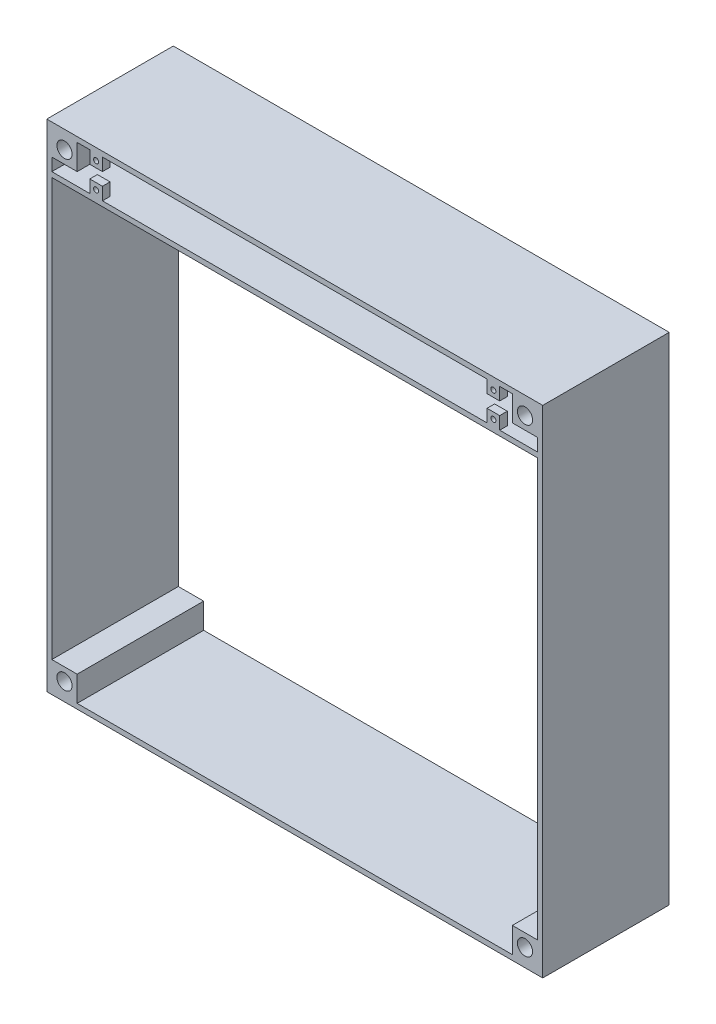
ISO-10303-21;
HEADER;
FILE_DESCRIPTION(('STEP AP214'),'2;1');
FILE_NAME('part.step','',(''),(''),'','','');
FILE_SCHEMA(('AUTOMOTIVE_DESIGN { 1 0 10303 214 1 1 1 1 }'));
ENDSEC;
DATA;
#1=APPLICATION_CONTEXT('core data for automotive mechanical design processes');
#2=APPLICATION_PROTOCOL_DEFINITION('international standard','automotive_design',2000,#1);
#3=PRODUCT_CONTEXT('',#1,'mechanical');
#4=PRODUCT('Part','Part','',(#3));
#5=PRODUCT_RELATED_PRODUCT_CATEGORY('part','',(#4));
#6=PRODUCT_DEFINITION_FORMATION('','',#4);
#7=PRODUCT_DEFINITION_CONTEXT('part definition',#1,'design');
#8=PRODUCT_DEFINITION('design','',#6,#7);
#9=PRODUCT_DEFINITION_SHAPE('','',#8);
#10=(LENGTH_UNIT() NAMED_UNIT(*) SI_UNIT(.MILLI.,.METRE.));
#11=(NAMED_UNIT(*) PLANE_ANGLE_UNIT() SI_UNIT($,.RADIAN.));
#12=(NAMED_UNIT(*) SI_UNIT($,.STERADIAN.) SOLID_ANGLE_UNIT());
#13=UNCERTAINTY_MEASURE_WITH_UNIT(LENGTH_MEASURE(1.E-05),#10,'distance_accuracy_value','');
#14=(GEOMETRIC_REPRESENTATION_CONTEXT(3) GLOBAL_UNCERTAINTY_ASSIGNED_CONTEXT((#13)) GLOBAL_UNIT_ASSIGNED_CONTEXT((#10,
#11,#12)) REPRESENTATION_CONTEXT('',''));
#15=CARTESIAN_POINT('',(0.,0.,0.));
#16=DIRECTION('',(0.,0.,1.));
#17=DIRECTION('',(1.,0.,0.));
#18=AXIS2_PLACEMENT_3D('',#15,#16,#17);
#19=CARTESIAN_POINT('',(2.54,0.,31.75));
#20=DIRECTION('',(-1.,0.,0.));
#21=DIRECTION('',(0.,0.,1.));
#22=AXIS2_PLACEMENT_3D('',#19,#20,#21);
#23=PLANE('',#22);
#24=DIRECTION('',(0.,0.,-1.));
#25=VECTOR('',#24,1.);
#26=CARTESIAN_POINT('',(2.54,233.68,31.75));
#27=LINE('',#26,#25);
#28=CARTESIAN_POINT('',(2.54,233.68,31.75));
#29=VERTEX_POINT('',#28);
#30=CARTESIAN_POINT('',(2.54,233.68,-31.75));
#31=VERTEX_POINT('',#30);
#32=EDGE_CURVE('E61',#29,#31,#27,.T.);
#33=ORIENTED_EDGE('',*,*,#32,.F.);
#34=DIRECTION('',(0.,1.,0.));
#35=VECTOR('',#34,1.);
#36=CARTESIAN_POINT('',(2.54,0.,31.75));
#37=LINE('',#36,#35);
#38=CARTESIAN_POINT('',(2.54,227.33,31.75));
#39=VERTEX_POINT('',#38);
#40=EDGE_CURVE('E373',#39,#29,#37,.T.);
#41=ORIENTED_EDGE('',*,*,#40,.F.);
#42=DIRECTION('',(0.,0.,-1.));
#43=VECTOR('',#42,1.);
#44=CARTESIAN_POINT('',(2.54,227.33,31.75));
#45=LINE('',#44,#43);
#46=CARTESIAN_POINT('',(2.54,227.33,-31.75));
#47=VERTEX_POINT('',#46);
#48=EDGE_CURVE('E798',#39,#47,#45,.T.);
#49=ORIENTED_EDGE('',*,*,#48,.T.);
#50=DIRECTION('',(0.,1.,0.));
#51=VECTOR('',#50,1.);
#52=CARTESIAN_POINT('',(2.54,0.,-31.75));
#53=LINE('',#52,#51);
#54=EDGE_CURVE('E838',#47,#31,#53,.T.);
#55=ORIENTED_EDGE('',*,*,#54,.T.);
#56=EDGE_LOOP('',(#33,#41,#49,#55));
#57=FACE_BOUND('',#56,.T.);
#58=ADVANCED_FACE('F38',(#57),#23,.F.);
#59=CARTESIAN_POINT('',(246.38,0.,31.75));
#60=DIRECTION('',(-1.,0.,0.));
#61=DIRECTION('',(0.,0.,1.));
#62=AXIS2_PLACEMENT_3D('',#59,#60,#61);
#63=PLANE('',#62);
#64=DIRECTION('',(0.,1.,0.));
#65=VECTOR('',#64,1.);
#66=CARTESIAN_POINT('',(246.38,0.,-31.75));
#67=LINE('',#66,#65);
#68=CARTESIAN_POINT('',(246.38,15.24,-31.75));
#69=VERTEX_POINT('',#68);
#70=CARTESIAN_POINT('',(246.38,224.79,-31.75));
#71=VERTEX_POINT('',#70);
#72=EDGE_CURVE('E806',#69,#71,#67,.T.);
#73=ORIENTED_EDGE('',*,*,#72,.F.);
#74=DIRECTION('',(0.,0.,-1.));
#75=VECTOR('',#74,1.);
#76=CARTESIAN_POINT('',(246.38,15.24,31.75));
#77=LINE('',#76,#75);
#78=CARTESIAN_POINT('',(246.38,15.24,31.75));
#79=VERTEX_POINT('',#78);
#80=EDGE_CURVE('E422',#79,#69,#77,.T.);
#81=ORIENTED_EDGE('',*,*,#80,.F.);
#82=DIRECTION('',(0.,1.,0.));
#83=VECTOR('',#82,1.);
#84=CARTESIAN_POINT('',(246.38,0.,31.75));
#85=LINE('',#84,#83);
#86=CARTESIAN_POINT('',(246.38,224.79,31.75));
#87=VERTEX_POINT('',#86);
#88=EDGE_CURVE('E822',#79,#87,#85,.T.);
#89=ORIENTED_EDGE('',*,*,#88,.T.);
#90=DIRECTION('',(0.,0.,-1.));
#91=VECTOR('',#90,1.);
#92=CARTESIAN_POINT('',(246.38,224.79,31.75));
#93=LINE('',#92,#91);
#94=EDGE_CURVE('E792',#87,#71,#93,.T.);
#95=ORIENTED_EDGE('',*,*,#94,.T.);
#96=EDGE_LOOP('',(#73,#81,#89,#95));
#97=FACE_BOUND('',#96,.T.);
#98=ADVANCED_FACE('F882',(#97),#63,.T.);
#99=CARTESIAN_POINT('',(0.,2.54,31.75));
#100=DIRECTION('',(0.,1.,0.));
#101=DIRECTION('',(0.,0.,1.));
#102=AXIS2_PLACEMENT_3D('',#99,#100,#101);
#103=PLANE('',#102);
#104=DIRECTION('',(0.,0.,-1.));
#105=VECTOR('',#104,1.);
#106=CARTESIAN_POINT('',(233.68,2.54,31.75));
#107=LINE('',#106,#105);
#108=CARTESIAN_POINT('',(233.68,2.54,31.75));
#109=VERTEX_POINT('',#108);
#110=CARTESIAN_POINT('',(233.68,2.54,-31.75));
#111=VERTEX_POINT('',#110);
#112=EDGE_CURVE('E410',#109,#111,#107,.T.);
#113=ORIENTED_EDGE('',*,*,#112,.T.);
#114=DIRECTION('',(1.,0.,0.));
#115=VECTOR('',#114,1.);
#116=CARTESIAN_POINT('',(0.,2.54,-31.75));
#117=LINE('',#116,#115);
#118=CARTESIAN_POINT('',(15.24,2.54,-31.75));
#119=VERTEX_POINT('',#118);
#120=EDGE_CURVE('E835',#119,#111,#117,.T.);
#121=ORIENTED_EDGE('',*,*,#120,.F.);
#122=DIRECTION('',(0.,0.,-1.));
#123=VECTOR('',#122,1.);
#124=CARTESIAN_POINT('',(15.24,2.54,31.75));
#125=LINE('',#124,#123);
#126=CARTESIAN_POINT('',(15.24,2.54,31.75));
#127=VERTEX_POINT('',#126);
#128=EDGE_CURVE('E447',#127,#119,#125,.T.);
#129=ORIENTED_EDGE('',*,*,#128,.F.);
#130=DIRECTION('',(1.,0.,0.));
#131=VECTOR('',#130,1.);
#132=CARTESIAN_POINT('',(0.,2.54,31.75));
#133=LINE('',#132,#131);
#134=EDGE_CURVE('E813',#127,#109,#133,.T.);
#135=ORIENTED_EDGE('',*,*,#134,.T.);
#136=EDGE_LOOP('',(#113,#121,#129,#135));
#137=FACE_BOUND('',#136,.T.);
#138=ADVANCED_FACE('F886',(#137),#103,.T.);
#139=CARTESIAN_POINT('',(0.,246.38,31.75));
#140=DIRECTION('',(0.,1.,0.));
#141=DIRECTION('',(0.,0.,1.));
#142=AXIS2_PLACEMENT_3D('',#139,#140,#141);
#143=PLANE('',#142);
#144=DIRECTION('',(1.,0.,0.));
#145=VECTOR('',#144,1.);
#146=CARTESIAN_POINT('',(0.,246.38,31.75));
#147=LINE('',#146,#145);
#148=CARTESIAN_POINT('',(15.24,246.38,31.75));
#149=VERTEX_POINT('',#148);
#150=CARTESIAN_POINT('',(21.59,246.38,31.75));
#151=VERTEX_POINT('',#150);
#152=EDGE_CURVE('E53',#149,#151,#147,.T.);
#153=ORIENTED_EDGE('',*,*,#152,.F.);
#154=DIRECTION('',(0.,0.,-1.));
#155=VECTOR('',#154,1.);
#156=CARTESIAN_POINT('',(15.24,246.38,31.75));
#157=LINE('',#156,#155);
#158=CARTESIAN_POINT('',(15.24,246.38,-31.75));
#159=VERTEX_POINT('',#158);
#160=EDGE_CURVE('E385',#149,#159,#157,.T.);
#161=ORIENTED_EDGE('',*,*,#160,.T.);
#162=DIRECTION('',(1.,0.,0.));
#163=VECTOR('',#162,1.);
#164=CARTESIAN_POINT('',(0.,246.38,-31.75));
#165=LINE('',#164,#163);
#166=CARTESIAN_POINT('',(21.59,246.38,-31.75));
#167=VERTEX_POINT('',#166);
#168=EDGE_CURVE('E842',#159,#167,#165,.T.);
#169=ORIENTED_EDGE('',*,*,#168,.T.);
#170=DIRECTION('',(0.,0.,-1.));
#171=VECTOR('',#170,1.);
#172=CARTESIAN_POINT('',(21.59,246.38,-27.94));
#173=LINE('',#172,#171);
#174=CARTESIAN_POINT('',(21.59,246.38,-27.94));
#175=VERTEX_POINT('',#174);
#176=EDGE_CURVE('E498',#175,#167,#173,.T.);
#177=ORIENTED_EDGE('',*,*,#176,.F.);
#178=DIRECTION('',(1.,0.,0.));
#179=VECTOR('',#178,1.);
#180=CARTESIAN_POINT('',(0.,246.38,-27.94));
#181=LINE('',#180,#179);
#182=CARTESIAN_POINT('',(27.94,246.38,-27.94));
#183=VERTEX_POINT('',#182);
#184=EDGE_CURVE('E476',#175,#183,#181,.T.);
#185=ORIENTED_EDGE('',*,*,#184,.T.);
#186=DIRECTION('',(0.,0.,-1.));
#187=VECTOR('',#186,1.);
#188=CARTESIAN_POINT('',(27.94,246.38,-27.94));
#189=LINE('',#188,#187);
#190=CARTESIAN_POINT('',(27.94,246.38,-31.75));
#191=VERTEX_POINT('',#190);
#192=EDGE_CURVE('E489',#183,#191,#189,.T.);
#193=ORIENTED_EDGE('',*,*,#192,.T.);
#194=CARTESIAN_POINT('',(220.98,246.38,-31.75));
#195=VERTEX_POINT('',#194);
#196=EDGE_CURVE('E845',#191,#195,#165,.T.);
#197=ORIENTED_EDGE('',*,*,#196,.T.);
#198=DIRECTION('',(0.,0.,-1.));
#199=VECTOR('',#198,1.);
#200=CARTESIAN_POINT('',(220.98,246.38,-27.94));
#201=LINE('',#200,#199);
#202=CARTESIAN_POINT('',(220.98,246.38,-27.94));
#203=VERTEX_POINT('',#202);
#204=EDGE_CURVE('E525',#203,#195,#201,.T.);
#205=ORIENTED_EDGE('',*,*,#204,.F.);
#206=DIRECTION('',(1.,0.,0.));
#207=VECTOR('',#206,1.);
#208=CARTESIAN_POINT('',(0.,246.38,-27.94));
#209=LINE('',#208,#207);
#210=CARTESIAN_POINT('',(227.33,246.38,-27.94));
#211=VERTEX_POINT('',#210);
#212=EDGE_CURVE('E517',#203,#211,#209,.T.);
#213=ORIENTED_EDGE('',*,*,#212,.T.);
#214=DIRECTION('',(0.,0.,-1.));
#215=VECTOR('',#214,1.);
#216=CARTESIAN_POINT('',(227.33,246.38,-27.94));
#217=LINE('',#216,#215);
#218=CARTESIAN_POINT('',(227.33,246.38,-31.75));
#219=VERTEX_POINT('',#218);
#220=EDGE_CURVE('E541',#211,#219,#217,.T.);
#221=ORIENTED_EDGE('',*,*,#220,.T.);
#222=CARTESIAN_POINT('',(233.68,246.38,-31.75));
#223=VERTEX_POINT('',#222);
#224=EDGE_CURVE('E841',#219,#223,#165,.T.);
#225=ORIENTED_EDGE('',*,*,#224,.T.);
#226=DIRECTION('',(0.,0.,-1.));
#227=VECTOR('',#226,1.);
#228=CARTESIAN_POINT('',(233.68,246.38,31.75));
#229=LINE('',#228,#227);
#230=CARTESIAN_POINT('',(233.68,246.38,31.75));
#231=VERTEX_POINT('',#230);
#232=EDGE_CURVE('E472',#231,#223,#229,.T.);
#233=ORIENTED_EDGE('',*,*,#232,.F.);
#234=CARTESIAN_POINT('',(227.33,246.38,31.75));
#235=VERTEX_POINT('',#234);
#236=EDGE_CURVE('E818',#235,#231,#147,.T.);
#237=ORIENTED_EDGE('',*,*,#236,.F.);
#238=DIRECTION('',(0.,0.,1.));
#239=VECTOR('',#238,1.);
#240=CARTESIAN_POINT('',(227.33,246.38,27.94));
#241=LINE('',#240,#239);
#242=CARTESIAN_POINT('',(227.33,246.38,27.94));
#243=VERTEX_POINT('',#242);
#244=EDGE_CURVE('E675',#243,#235,#241,.T.);
#245=ORIENTED_EDGE('',*,*,#244,.F.);
#246=DIRECTION('',(1.,0.,0.));
#247=VECTOR('',#246,1.);
#248=CARTESIAN_POINT('',(0.,246.38,27.94));
#249=LINE('',#248,#247);
#250=CARTESIAN_POINT('',(220.98,246.38,27.94));
#251=VERTEX_POINT('',#250);
#252=EDGE_CURVE('E660',#251,#243,#249,.T.);
#253=ORIENTED_EDGE('',*,*,#252,.F.);
#254=DIRECTION('',(0.,0.,1.));
#255=VECTOR('',#254,1.);
#256=CARTESIAN_POINT('',(220.98,246.38,27.94));
#257=LINE('',#256,#255);
#258=CARTESIAN_POINT('',(220.98,246.38,31.75));
#259=VERTEX_POINT('',#258);
#260=EDGE_CURVE('E671',#251,#259,#257,.T.);
#261=ORIENTED_EDGE('',*,*,#260,.T.);
#262=CARTESIAN_POINT('',(27.94,246.38,31.75));
#263=VERTEX_POINT('',#262);
#264=EDGE_CURVE('E821',#263,#259,#147,.T.);
#265=ORIENTED_EDGE('',*,*,#264,.F.);
#266=DIRECTION('',(0.,0.,1.));
#267=VECTOR('',#266,1.);
#268=CARTESIAN_POINT('',(27.94,246.38,27.94));
#269=LINE('',#268,#267);
#270=CARTESIAN_POINT('',(27.94,246.38,27.94));
#271=VERTEX_POINT('',#270);
#272=EDGE_CURVE('E641',#271,#263,#269,.T.);
#273=ORIENTED_EDGE('',*,*,#272,.F.);
#274=DIRECTION('',(1.,0.,0.));
#275=VECTOR('',#274,1.);
#276=CARTESIAN_POINT('',(0.,246.38,27.94));
#277=LINE('',#276,#275);
#278=CARTESIAN_POINT('',(21.59,246.38,27.94));
#279=VERTEX_POINT('',#278);
#280=EDGE_CURVE('E616',#279,#271,#277,.T.);
#281=ORIENTED_EDGE('',*,*,#280,.F.);
#282=DIRECTION('',(0.,0.,1.));
#283=VECTOR('',#282,1.);
#284=CARTESIAN_POINT('',(21.59,246.38,27.94));
#285=LINE('',#284,#283);
#286=EDGE_CURVE('E631',#279,#151,#285,.T.);
#287=ORIENTED_EDGE('',*,*,#286,.T.);
#288=EDGE_LOOP('',(#153,#161,#169,#177,#185,#193,#197,#205,#213,#221,#225,#233,#237,#245,#253,
#261,#265,#273,#281,#287));
#289=FACE_BOUND('',#288,.T.);
#290=ADVANCED_FACE('F892',(#289),#143,.F.);
#291=CARTESIAN_POINT('',(243.84,227.33,31.75));
#292=DIRECTION('',(0.,1.,0.));
#293=DIRECTION('',(0.,0.,1.));
#294=AXIS2_PLACEMENT_3D('',#291,#292,#293);
#295=PLANE('',#294);
#296=DIRECTION('',(0.,0.,-1.));
#297=VECTOR('',#296,1.);
#298=CARTESIAN_POINT('',(27.94,227.33,-27.94));
#299=LINE('',#298,#297);
#300=CARTESIAN_POINT('',(27.94,227.33,-27.94));
#301=VERTEX_POINT('',#300);
#302=CARTESIAN_POINT('',(27.94,227.33,-31.75));
#303=VERTEX_POINT('',#302);
#304=EDGE_CURVE('E562',#301,#303,#299,.T.);
#305=ORIENTED_EDGE('',*,*,#304,.F.);
#306=DIRECTION('',(-1.,0.,0.));
#307=VECTOR('',#306,1.);
#308=CARTESIAN_POINT('',(0.,227.33,-27.94));
#309=LINE('',#308,#307);
#310=CARTESIAN_POINT('',(21.59,227.33,-27.94));
#311=VERTEX_POINT('',#310);
#312=EDGE_CURVE('E553',#301,#311,#309,.T.);
#313=ORIENTED_EDGE('',*,*,#312,.T.);
#314=DIRECTION('',(0.,0.,-1.));
#315=VECTOR('',#314,1.);
#316=CARTESIAN_POINT('',(21.59,227.33,-27.94));
#317=LINE('',#316,#315);
#318=CARTESIAN_POINT('',(21.59,227.33,-31.75));
#319=VERTEX_POINT('',#318);
#320=EDGE_CURVE('E577',#311,#319,#317,.T.);
#321=ORIENTED_EDGE('',*,*,#320,.T.);
#322=DIRECTION('',(1.,0.,0.));
#323=VECTOR('',#322,1.);
#324=CARTESIAN_POINT('',(243.84,227.33,-31.75));
#325=LINE('',#324,#323);
#326=EDGE_CURVE('E786',#47,#319,#325,.T.);
#327=ORIENTED_EDGE('',*,*,#326,.F.);
#328=ORIENTED_EDGE('',*,*,#48,.F.);
#329=DIRECTION('',(1.,0.,0.));
#330=VECTOR('',#329,1.);
#331=CARTESIAN_POINT('',(2.54,227.33,31.75));
#332=LINE('',#331,#330);
#333=CARTESIAN_POINT('',(21.59,227.33,31.75));
#334=VERTEX_POINT('',#333);
#335=EDGE_CURVE('E779',#334,#39,#332,.F.);
#336=ORIENTED_EDGE('',*,*,#335,.F.);
#337=DIRECTION('',(0.,0.,1.));
#338=VECTOR('',#337,1.);
#339=CARTESIAN_POINT('',(21.59,227.33,27.94));
#340=LINE('',#339,#338);
#341=CARTESIAN_POINT('',(21.59,227.33,27.94));
#342=VERTEX_POINT('',#341);
#343=EDGE_CURVE('E707',#342,#334,#340,.T.);
#344=ORIENTED_EDGE('',*,*,#343,.F.);
#345=DIRECTION('',(-1.,0.,0.));
#346=VECTOR('',#345,1.);
#347=CARTESIAN_POINT('',(0.,227.33,27.94));
#348=LINE('',#347,#346);
#349=CARTESIAN_POINT('',(27.94,227.33,27.94));
#350=VERTEX_POINT('',#349);
#351=EDGE_CURVE('E693',#350,#342,#348,.T.);
#352=ORIENTED_EDGE('',*,*,#351,.F.);
#353=DIRECTION('',(0.,0.,1.));
#354=VECTOR('',#353,1.);
#355=CARTESIAN_POINT('',(27.94,227.33,27.94));
#356=LINE('',#355,#354);
#357=CARTESIAN_POINT('',(27.94,227.33,31.75));
#358=VERTEX_POINT('',#357);
#359=EDGE_CURVE('E703',#350,#358,#356,.T.);
#360=ORIENTED_EDGE('',*,*,#359,.T.);
#361=CARTESIAN_POINT('',(220.98,227.33,31.75));
#362=VERTEX_POINT('',#361);
#363=EDGE_CURVE('E778',#362,#358,#332,.F.);
#364=ORIENTED_EDGE('',*,*,#363,.F.);
#365=DIRECTION('',(0.,0.,1.));
#366=VECTOR('',#365,1.);
#367=CARTESIAN_POINT('',(220.98,227.33,27.94));
#368=LINE('',#367,#366);
#369=CARTESIAN_POINT('',(220.98,227.33,27.94));
#370=VERTEX_POINT('',#369);
#371=EDGE_CURVE('E740',#370,#362,#368,.T.);
#372=ORIENTED_EDGE('',*,*,#371,.F.);
#373=DIRECTION('',(-1.,0.,0.));
#374=VECTOR('',#373,1.);
#375=CARTESIAN_POINT('',(0.,227.33,27.94));
#376=LINE('',#375,#374);
#377=CARTESIAN_POINT('',(227.33,227.33,27.94));
#378=VERTEX_POINT('',#377);
#379=EDGE_CURVE('E715',#378,#370,#376,.T.);
#380=ORIENTED_EDGE('',*,*,#379,.F.);
#381=DIRECTION('',(0.,0.,1.));
#382=VECTOR('',#381,1.);
#383=CARTESIAN_POINT('',(227.33,227.33,27.94));
#384=LINE('',#383,#382);
#385=CARTESIAN_POINT('',(227.33,227.33,31.75));
#386=VERTEX_POINT('',#385);
#387=EDGE_CURVE('E730',#378,#386,#384,.T.);
#388=ORIENTED_EDGE('',*,*,#387,.T.);
#389=CARTESIAN_POINT('',(246.38,227.33,31.75));
#390=VERTEX_POINT('',#389);
#391=EDGE_CURVE('E774',#390,#386,#332,.F.);
#392=ORIENTED_EDGE('',*,*,#391,.F.);
#393=DIRECTION('',(0.,0.,-1.));
#394=VECTOR('',#393,1.);
#395=CARTESIAN_POINT('',(246.38,227.33,31.75));
#396=LINE('',#395,#394);
#397=CARTESIAN_POINT('',(246.38,227.33,-31.75));
#398=VERTEX_POINT('',#397);
#399=EDGE_CURVE('E782',#390,#398,#396,.T.);
#400=ORIENTED_EDGE('',*,*,#399,.T.);
#401=CARTESIAN_POINT('',(227.33,227.33,-31.75));
#402=VERTEX_POINT('',#401);
#403=EDGE_CURVE('E785',#402,#398,#325,.T.);
#404=ORIENTED_EDGE('',*,*,#403,.F.);
#405=DIRECTION('',(0.,0.,-1.));
#406=VECTOR('',#405,1.);
#407=CARTESIAN_POINT('',(227.33,227.33,-27.94));
#408=LINE('',#407,#406);
#409=CARTESIAN_POINT('',(227.33,227.33,-27.94));
#410=VERTEX_POINT('',#409);
#411=EDGE_CURVE('E604',#410,#402,#408,.T.);
#412=ORIENTED_EDGE('',*,*,#411,.F.);
#413=DIRECTION('',(-1.,0.,0.));
#414=VECTOR('',#413,1.);
#415=CARTESIAN_POINT('',(0.,227.33,-27.94));
#416=LINE('',#415,#414);
#417=CARTESIAN_POINT('',(220.98,227.33,-27.94));
#418=VERTEX_POINT('',#417);
#419=EDGE_CURVE('E582',#410,#418,#416,.T.);
#420=ORIENTED_EDGE('',*,*,#419,.T.);
#421=DIRECTION('',(0.,0.,-1.));
#422=VECTOR('',#421,1.);
#423=CARTESIAN_POINT('',(220.98,227.33,-27.94));
#424=LINE('',#423,#422);
#425=CARTESIAN_POINT('',(220.98,227.33,-31.75));
#426=VERTEX_POINT('',#425);
#427=EDGE_CURVE('E595',#418,#426,#424,.T.);
#428=ORIENTED_EDGE('',*,*,#427,.T.);
#429=EDGE_CURVE('E789',#303,#426,#325,.T.);
#430=ORIENTED_EDGE('',*,*,#429,.F.);
#431=EDGE_LOOP('',(#305,#313,#321,#327,#328,#336,#344,#352,#360,#364,#372,#380,#388,#392,#400,
#404,#412,#420,#428,#430));
#432=FACE_BOUND('',#431,.T.);
#433=CARTESIAN_POINT('',(215.9,227.33,0.));
#434=DIRECTION('',(0.,-1.,0.));
#435=DIRECTION('',(0.,0.,-1.));
#436=AXIS2_PLACEMENT_3D('',#433,#434,#435);
#437=CIRCLE('',#436,6.35);
#438=CARTESIAN_POINT('',(215.9,227.33,-6.35));
#439=VERTEX_POINT('',#438);
#440=EDGE_CURVE('E743',#439,#439,#437,.T.);
#441=ORIENTED_EDGE('',*,*,#440,.T.);
#442=EDGE_LOOP('',(#441));
#443=FACE_BOUND('',#442,.T.);
#444=CARTESIAN_POINT('',(33.02,227.33,0.));
#445=DIRECTION('',(0.,-1.,0.));
#446=DIRECTION('',(0.,0.,-1.));
#447=AXIS2_PLACEMENT_3D('',#444,#445,#446);
#448=CIRCLE('',#447,6.35);
#449=CARTESIAN_POINT('',(33.02,227.33,-6.35));
#450=VERTEX_POINT('',#449);
#451=EDGE_CURVE('E760',#450,#450,#448,.T.);
#452=ORIENTED_EDGE('',*,*,#451,.T.);
#453=EDGE_LOOP('',(#452));
#454=FACE_BOUND('',#453,.T.);
#455=CARTESIAN_POINT('',(154.94,227.33,0.));
#456=DIRECTION('',(0.,-1.,0.));
#457=DIRECTION('',(0.,0.,-1.));
#458=AXIS2_PLACEMENT_3D('',#455,#456,#457);
#459=CIRCLE('',#458,8.22023006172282);
#460=CARTESIAN_POINT('',(154.94,227.33,-8.22023006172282));
#461=VERTEX_POINT('',#460);
#462=EDGE_CURVE('E754',#461,#461,#459,.T.);
#463=ORIENTED_EDGE('',*,*,#462,.T.);
#464=EDGE_LOOP('',(#463));
#465=FACE_BOUND('',#464,.T.);
#466=CARTESIAN_POINT('',(93.98,227.33,0.));
#467=DIRECTION('',(0.,-1.,0.));
#468=DIRECTION('',(0.,0.,-1.));
#469=AXIS2_PLACEMENT_3D('',#466,#467,#468);
#470=CIRCLE('',#469,8.86349447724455);
#471=CARTESIAN_POINT('',(93.98,227.33,-8.86349447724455));
#472=VERTEX_POINT('',#471);
#473=EDGE_CURVE('E768',#472,#472,#470,.T.);
#474=ORIENTED_EDGE('',*,*,#473,.T.);
#475=EDGE_LOOP('',(#474));
#476=FACE_BOUND('',#475,.T.);
#477=ADVANCED_FACE('F878',(#432,#443,#454,#465,#476),#295,.T.);
#478=CARTESIAN_POINT('',(2.54,15.24,31.75));
#479=VERTEX_POINT('',#478);
#480=CARTESIAN_POINT('',(2.54,224.79,31.75));
#481=VERTEX_POINT('',#480);
#482=EDGE_CURVE('E816',#479,#481,#37,.T.);
#483=ORIENTED_EDGE('',*,*,#482,.F.);
#484=DIRECTION('',(0.,0.,-1.));
#485=VECTOR('',#484,1.);
#486=CARTESIAN_POINT('',(2.54,15.24,31.75));
#487=LINE('',#486,#485);
#488=CARTESIAN_POINT('',(2.54,15.24,-31.75));
#489=VERTEX_POINT('',#488);
#490=EDGE_CURVE('E435',#479,#489,#487,.T.);
#491=ORIENTED_EDGE('',*,*,#490,.T.);
#492=CARTESIAN_POINT('',(2.54,224.79,-31.75));
#493=VERTEX_POINT('',#492);
#494=EDGE_CURVE('E839',#489,#493,#53,.T.);
#495=ORIENTED_EDGE('',*,*,#494,.T.);
#496=DIRECTION('',(0.,0.,-1.));
#497=VECTOR('',#496,1.);
#498=CARTESIAN_POINT('',(2.54,224.79,31.75));
#499=LINE('',#498,#497);
#500=EDGE_CURVE('E795',#481,#493,#499,.T.);
#501=ORIENTED_EDGE('',*,*,#500,.F.);
#502=EDGE_LOOP('',(#483,#491,#495,#501));
#503=FACE_BOUND('',#502,.T.);
#504=ADVANCED_FACE('F873',(#503),#23,.F.);
#505=CARTESIAN_POINT('',(0.,0.,31.75));
#506=DIRECTION('',(-1.,0.,0.));
#507=DIRECTION('',(0.,0.,1.));
#508=AXIS2_PLACEMENT_3D('',#505,#506,#507);
#509=PLANE('',#508);
#510=DIRECTION('',(0.,1.,0.));
#511=VECTOR('',#510,1.);
#512=CARTESIAN_POINT('',(0.,0.,-31.75));
#513=LINE('',#512,#511);
#514=CARTESIAN_POINT('',(0.,0.,-31.75));
#515=VERTEX_POINT('',#514);
#516=CARTESIAN_POINT('',(0.,248.92,-31.75));
#517=VERTEX_POINT('',#516);
#518=EDGE_CURVE('E801',#515,#517,#513,.T.);
#519=ORIENTED_EDGE('',*,*,#518,.F.);
#520=DIRECTION('',(0.,0.,-1.));
#521=VECTOR('',#520,1.);
#522=CARTESIAN_POINT('',(0.,0.,31.75));
#523=LINE('',#522,#521);
#524=CARTESIAN_POINT('',(0.,0.,31.75));
#525=VERTEX_POINT('',#524);
#526=EDGE_CURVE('E11',#525,#515,#523,.T.);
#527=ORIENTED_EDGE('',*,*,#526,.F.);
#528=DIRECTION('',(0.,1.,0.));
#529=VECTOR('',#528,1.);
#530=CARTESIAN_POINT('',(0.,0.,31.75));
#531=LINE('',#530,#529);
#532=CARTESIAN_POINT('',(0.,248.92,31.75));
#533=VERTEX_POINT('',#532);
#534=EDGE_CURVE('E802',#525,#533,#531,.T.);
#535=ORIENTED_EDGE('',*,*,#534,.T.);
#536=DIRECTION('',(0.,0.,-1.));
#537=VECTOR('',#536,1.);
#538=CARTESIAN_POINT('',(0.,248.92,31.75));
#539=LINE('',#538,#537);
#540=EDGE_CURVE('E824',#533,#517,#539,.T.);
#541=ORIENTED_EDGE('',*,*,#540,.T.);
#542=EDGE_LOOP('',(#519,#527,#535,#541));
#543=FACE_BOUND('',#542,.T.);
#544=ADVANCED_FACE('F40',(#543),#509,.T.);
#545=CARTESIAN_POINT('',(0.,0.,31.75));
#546=DIRECTION('',(0.,1.,0.));
#547=DIRECTION('',(0.,0.,1.));
#548=AXIS2_PLACEMENT_3D('',#545,#546,#547);
#549=PLANE('',#548);
#550=DIRECTION('',(1.,0.,0.));
#551=VECTOR('',#550,1.);
#552=CARTESIAN_POINT('',(0.,0.,-31.75));
#553=LINE('',#552,#551);
#554=CARTESIAN_POINT('',(248.92,0.,-31.75));
#555=VERTEX_POINT('',#554);
#556=EDGE_CURVE('E827',#515,#555,#553,.T.);
#557=ORIENTED_EDGE('',*,*,#556,.T.);
#558=DIRECTION('',(0.,0.,-1.));
#559=VECTOR('',#558,1.);
#560=CARTESIAN_POINT('',(248.92,0.,31.75));
#561=LINE('',#560,#559);
#562=CARTESIAN_POINT('',(248.92,0.,31.75));
#563=VERTEX_POINT('',#562);
#564=EDGE_CURVE('E46',#563,#555,#561,.T.);
#565=ORIENTED_EDGE('',*,*,#564,.F.);
#566=DIRECTION('',(1.,0.,0.));
#567=VECTOR('',#566,1.);
#568=CARTESIAN_POINT('',(0.,0.,31.75));
#569=LINE('',#568,#567);
#570=EDGE_CURVE('E805',#525,#563,#569,.T.);
#571=ORIENTED_EDGE('',*,*,#570,.F.);
#572=ORIENTED_EDGE('',*,*,#526,.T.);
#573=EDGE_LOOP('',(#557,#565,#571,#572));
#574=FACE_BOUND('',#573,.T.);
#575=ADVANCED_FACE('F870',(#574),#549,.F.);
#576=CARTESIAN_POINT('',(248.92,0.,31.75));
#577=DIRECTION('',(-1.,0.,0.));
#578=DIRECTION('',(0.,0.,1.));
#579=AXIS2_PLACEMENT_3D('',#576,#577,#578);
#580=PLANE('',#579);
#581=DIRECTION('',(0.,1.,0.));
#582=VECTOR('',#581,1.);
#583=CARTESIAN_POINT('',(248.92,0.,-31.75));
#584=LINE('',#583,#582);
#585=CARTESIAN_POINT('',(248.92,248.92,-31.75));
#586=VERTEX_POINT('',#585);
#587=EDGE_CURVE('E829',#555,#586,#584,.T.);
#588=ORIENTED_EDGE('',*,*,#587,.T.);
#589=DIRECTION('',(0.,0.,-1.));
#590=VECTOR('',#589,1.);
#591=CARTESIAN_POINT('',(248.92,248.92,31.75));
#592=LINE('',#591,#590);
#593=CARTESIAN_POINT('',(248.92,248.92,31.75));
#594=VERTEX_POINT('',#593);
#595=EDGE_CURVE('E848',#594,#586,#592,.T.);
#596=ORIENTED_EDGE('',*,*,#595,.F.);
#597=DIRECTION('',(0.,1.,0.));
#598=VECTOR('',#597,1.);
#599=CARTESIAN_POINT('',(248.92,0.,31.75));
#600=LINE('',#599,#598);
#601=EDGE_CURVE('E808',#563,#594,#600,.T.);
#602=ORIENTED_EDGE('',*,*,#601,.F.);
#603=ORIENTED_EDGE('',*,*,#564,.T.);
#604=EDGE_LOOP('',(#588,#596,#602,#603));
#605=FACE_BOUND('',#604,.T.);
#606=ADVANCED_FACE('F854',(#605),#580,.F.);
#607=CARTESIAN_POINT('',(0.,248.92,31.75));
#608=DIRECTION('',(0.,1.,0.));
#609=DIRECTION('',(0.,0.,1.));
#610=AXIS2_PLACEMENT_3D('',#607,#608,#609);
#611=PLANE('',#610);
#612=DIRECTION('',(1.,0.,0.));
#613=VECTOR('',#612,1.);
#614=CARTESIAN_POINT('',(0.,248.92,-31.75));
#615=LINE('',#614,#613);
#616=EDGE_CURVE('E832',#517,#586,#615,.T.);
#617=ORIENTED_EDGE('',*,*,#616,.F.);
#618=ORIENTED_EDGE('',*,*,#540,.F.);
#619=DIRECTION('',(1.,0.,0.));
#620=VECTOR('',#619,1.);
#621=CARTESIAN_POINT('',(0.,248.92,31.75));
#622=LINE('',#621,#620);
#623=EDGE_CURVE('E810',#533,#594,#622,.T.);
#624=ORIENTED_EDGE('',*,*,#623,.T.);
#625=ORIENTED_EDGE('',*,*,#595,.T.);
#626=EDGE_LOOP('',(#617,#618,#624,#625));
#627=FACE_BOUND('',#626,.T.);
#628=ADVANCED_FACE('F865',(#627),#611,.T.);
#629=DIRECTION('',(0.,0.,-1.));
#630=VECTOR('',#629,1.);
#631=CARTESIAN_POINT('',(246.38,233.68,31.75));
#632=LINE('',#631,#630);
#633=CARTESIAN_POINT('',(246.38,233.68,31.75));
#634=VERTEX_POINT('',#633);
#635=CARTESIAN_POINT('',(246.38,233.68,-31.75));
#636=VERTEX_POINT('',#635);
#637=EDGE_CURVE('E460',#634,#636,#632,.T.);
#638=ORIENTED_EDGE('',*,*,#637,.T.);
#639=EDGE_CURVE('E844',#398,#636,#67,.T.);
#640=ORIENTED_EDGE('',*,*,#639,.F.);
#641=ORIENTED_EDGE('',*,*,#399,.F.);
#642=EDGE_CURVE('E820',#390,#634,#85,.T.);
#643=ORIENTED_EDGE('',*,*,#642,.T.);
#644=EDGE_LOOP('',(#638,#640,#641,#643));
#645=FACE_BOUND('',#644,.T.);
#646=ADVANCED_FACE('F889',(#645),#63,.T.);
#647=CARTESIAN_POINT('',(0.,0.,31.75));
#648=DIRECTION('',(0.,0.,1.));
#649=DIRECTION('',(1.,0.,0.));
#650=AXIS2_PLACEMENT_3D('',#647,#648,#649);
#651=PLANE('',#650);
#652=DIRECTION('',(0.,-1.,0.));
#653=VECTOR('',#652,1.);
#654=CARTESIAN_POINT('',(15.24,0.,31.75));
#655=LINE('',#654,#653);
#656=CARTESIAN_POINT('',(15.24,233.68,31.75));
#657=VERTEX_POINT('',#656);
#658=EDGE_CURVE('E372',#149,#657,#655,.T.);
#659=ORIENTED_EDGE('',*,*,#658,.F.);
#660=ORIENTED_EDGE('',*,*,#152,.T.);
#661=DIRECTION('',(0.,-1.,0.));
#662=VECTOR('',#661,1.);
#663=CARTESIAN_POINT('',(21.59,0.,31.75));
#664=LINE('',#663,#662);
#665=CARTESIAN_POINT('',(21.59,240.03,31.75));
#666=VERTEX_POINT('',#665);
#667=EDGE_CURVE('E607',#151,#666,#664,.T.);
#668=ORIENTED_EDGE('',*,*,#667,.T.);
#669=DIRECTION('',(1.,0.,0.));
#670=VECTOR('',#669,1.);
#671=CARTESIAN_POINT('',(0.,240.03,31.75));
#672=LINE('',#671,#670);
#673=CARTESIAN_POINT('',(27.94,240.03,31.75));
#674=VERTEX_POINT('',#673);
#675=EDGE_CURVE('E634',#666,#674,#672,.T.);
#676=ORIENTED_EDGE('',*,*,#675,.T.);
#677=DIRECTION('',(0.,1.,0.));
#678=VECTOR('',#677,1.);
#679=CARTESIAN_POINT('',(27.94,0.,31.75));
#680=LINE('',#679,#678);
#681=EDGE_CURVE('E637',#674,#263,#680,.T.);
#682=ORIENTED_EDGE('',*,*,#681,.T.);
#683=ORIENTED_EDGE('',*,*,#264,.T.);
#684=DIRECTION('',(0.,1.,0.));
#685=VECTOR('',#684,1.);
#686=CARTESIAN_POINT('',(220.98,0.,31.75));
#687=LINE('',#686,#685);
#688=CARTESIAN_POINT('',(220.98,240.03,31.75));
#689=VERTEX_POINT('',#688);
#690=EDGE_CURVE('E665',#689,#259,#687,.T.);
#691=ORIENTED_EDGE('',*,*,#690,.F.);
#692=DIRECTION('',(-1.,0.,0.));
#693=VECTOR('',#692,1.);
#694=CARTESIAN_POINT('',(0.,240.03,31.75));
#695=LINE('',#694,#693);
#696=CARTESIAN_POINT('',(227.33,240.03,31.75));
#697=VERTEX_POINT('',#696);
#698=EDGE_CURVE('E668',#697,#689,#695,.T.);
#699=ORIENTED_EDGE('',*,*,#698,.F.);
#700=DIRECTION('',(0.,-1.,0.));
#701=VECTOR('',#700,1.);
#702=CARTESIAN_POINT('',(227.33,0.,31.75));
#703=LINE('',#702,#701);
#704=EDGE_CURVE('E654',#235,#697,#703,.T.);
#705=ORIENTED_EDGE('',*,*,#704,.F.);
#706=ORIENTED_EDGE('',*,*,#236,.T.);
#707=DIRECTION('',(0.,-1.,0.));
#708=VECTOR('',#707,1.);
#709=CARTESIAN_POINT('',(233.68,0.,31.75));
#710=LINE('',#709,#708);
#711=CARTESIAN_POINT('',(233.68,233.68,31.75));
#712=VERTEX_POINT('',#711);
#713=EDGE_CURVE('E454',#231,#712,#710,.T.);
#714=ORIENTED_EDGE('',*,*,#713,.T.);
#715=DIRECTION('',(-1.,0.,0.));
#716=VECTOR('',#715,1.);
#717=CARTESIAN_POINT('',(0.,233.68,31.75));
#718=LINE('',#717,#716);
#719=EDGE_CURVE('E457',#634,#712,#718,.T.);
#720=ORIENTED_EDGE('',*,*,#719,.F.);
#721=ORIENTED_EDGE('',*,*,#642,.F.);
#722=ORIENTED_EDGE('',*,*,#391,.T.);
#723=DIRECTION('',(0.,1.,0.));
#724=VECTOR('',#723,1.);
#725=CARTESIAN_POINT('',(227.33,0.,31.75));
#726=LINE('',#725,#724);
#727=CARTESIAN_POINT('',(227.33,233.68,31.75));
#728=VERTEX_POINT('',#727);
#729=EDGE_CURVE('E706',#386,#728,#726,.T.);
#730=ORIENTED_EDGE('',*,*,#729,.T.);
#731=DIRECTION('',(-1.,0.,0.));
#732=VECTOR('',#731,1.);
#733=CARTESIAN_POINT('',(0.,233.68,31.75));
#734=LINE('',#733,#732);
#735=CARTESIAN_POINT('',(220.98,233.68,31.75));
#736=VERTEX_POINT('',#735);
#737=EDGE_CURVE('E733',#728,#736,#734,.T.);
#738=ORIENTED_EDGE('',*,*,#737,.T.);
#739=DIRECTION('',(0.,-1.,0.));
#740=VECTOR('',#739,1.);
#741=CARTESIAN_POINT('',(220.98,0.,31.75));
#742=LINE('',#741,#740);
#743=EDGE_CURVE('E736',#736,#362,#742,.T.);
#744=ORIENTED_EDGE('',*,*,#743,.T.);
#745=ORIENTED_EDGE('',*,*,#363,.T.);
#746=DIRECTION('',(0.,-1.,0.));
#747=VECTOR('',#746,1.);
#748=CARTESIAN_POINT('',(27.94,0.,31.75));
#749=LINE('',#748,#747);
#750=CARTESIAN_POINT('',(27.94,233.68,31.75));
#751=VERTEX_POINT('',#750);
#752=EDGE_CURVE('E698',#751,#358,#749,.T.);
#753=ORIENTED_EDGE('',*,*,#752,.F.);
#754=DIRECTION('',(1.,0.,0.));
#755=VECTOR('',#754,1.);
#756=CARTESIAN_POINT('',(0.,233.68,31.75));
#757=LINE('',#756,#755);
#758=CARTESIAN_POINT('',(21.59,233.68,31.75));
#759=VERTEX_POINT('',#758);
#760=EDGE_CURVE('E700',#759,#751,#757,.T.);
#761=ORIENTED_EDGE('',*,*,#760,.F.);
#762=DIRECTION('',(0.,1.,0.));
#763=VECTOR('',#762,1.);
#764=CARTESIAN_POINT('',(21.59,0.,31.75));
#765=LINE('',#764,#763);
#766=EDGE_CURVE('E687',#334,#759,#765,.T.);
#767=ORIENTED_EDGE('',*,*,#766,.F.);
#768=ORIENTED_EDGE('',*,*,#335,.T.);
#769=ORIENTED_EDGE('',*,*,#40,.T.);
#770=DIRECTION('',(1.,0.,0.));
#771=VECTOR('',#770,1.);
#772=CARTESIAN_POINT('',(0.,233.68,31.75));
#773=LINE('',#772,#771);
#774=EDGE_CURVE('E367',#29,#657,#773,.T.);
#775=ORIENTED_EDGE('',*,*,#774,.T.);
#776=EDGE_LOOP('',(#659,#660,#668,#676,#682,#683,#691,#699,#705,#706,#714,#720,#721,#722,#730,
#738,#744,#745,#753,#761,#767,#768,#769,#775));
#777=FACE_BOUND('',#776,.T.);
#778=DIRECTION('',(0.,1.,0.));
#779=VECTOR('',#778,1.);
#780=CARTESIAN_POINT('',(233.68,0.,31.75));
#781=LINE('',#780,#779);
#782=CARTESIAN_POINT('',(233.68,15.24,31.75));
#783=VERTEX_POINT('',#782);
#784=EDGE_CURVE('E403',#109,#783,#781,.T.);
#785=ORIENTED_EDGE('',*,*,#784,.F.);
#786=ORIENTED_EDGE('',*,*,#134,.F.);
#787=DIRECTION('',(0.,1.,0.));
#788=VECTOR('',#787,1.);
#789=CARTESIAN_POINT('',(15.24,0.,31.75));
#790=LINE('',#789,#788);
#791=CARTESIAN_POINT('',(15.24,15.24,31.75));
#792=VERTEX_POINT('',#791);
#793=EDGE_CURVE('E429',#127,#792,#790,.T.);
#794=ORIENTED_EDGE('',*,*,#793,.T.);
#795=DIRECTION('',(1.,0.,0.));
#796=VECTOR('',#795,1.);
#797=CARTESIAN_POINT('',(0.,15.24,31.75));
#798=LINE('',#797,#796);
#799=EDGE_CURVE('E432',#479,#792,#798,.T.);
#800=ORIENTED_EDGE('',*,*,#799,.F.);
#801=ORIENTED_EDGE('',*,*,#482,.T.);
#802=DIRECTION('',(-1.,0.,0.));
#803=VECTOR('',#802,1.);
#804=CARTESIAN_POINT('',(2.54,224.79,31.75));
#805=LINE('',#804,#803);
#806=EDGE_CURVE('E777',#87,#481,#805,.T.);
#807=ORIENTED_EDGE('',*,*,#806,.F.);
#808=ORIENTED_EDGE('',*,*,#88,.F.);
#809=DIRECTION('',(-1.,0.,0.));
#810=VECTOR('',#809,1.);
#811=CARTESIAN_POINT('',(0.,15.24,31.75));
#812=LINE('',#811,#810);
#813=EDGE_CURVE('E401',#79,#783,#812,.T.);
#814=ORIENTED_EDGE('',*,*,#813,.T.);
#815=EDGE_LOOP('',(#785,#786,#794,#800,#801,#807,#808,#814));
#816=FACE_BOUND('',#815,.T.);
#817=ORIENTED_EDGE('',*,*,#534,.F.);
#818=ORIENTED_EDGE('',*,*,#570,.T.);
#819=ORIENTED_EDGE('',*,*,#601,.T.);
#820=ORIENTED_EDGE('',*,*,#623,.F.);
#821=EDGE_LOOP('',(#817,#818,#819,#820));
#822=FACE_BOUND('',#821,.T.);
#823=CARTESIAN_POINT('',(224.155,230.505,31.75));
#824=DIRECTION('',(0.,0.,1.));
#825=DIRECTION('',(1.,0.,0.));
#826=AXIS2_PLACEMENT_3D('',#823,#824,#825);
#827=CIRCLE('',#826,1.27000000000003);
#828=CARTESIAN_POINT('',(225.425,230.505,31.75));
#829=VERTEX_POINT('',#828);
#830=EDGE_CURVE('E718',#829,#829,#827,.F.);
#831=ORIENTED_EDGE('',*,*,#830,.T.);
#832=EDGE_LOOP('',(#831));
#833=FACE_BOUND('',#832,.T.);
#834=CARTESIAN_POINT('',(24.765,230.505,31.75));
#835=DIRECTION('',(0.,0.,1.));
#836=DIRECTION('',(1.,0.,0.));
#837=AXIS2_PLACEMENT_3D('',#834,#835,#836);
#838=CIRCLE('',#837,1.27000000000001);
#839=CARTESIAN_POINT('',(26.035,230.505,31.75));
#840=VERTEX_POINT('',#839);
#841=EDGE_CURVE('E674',#840,#840,#838,.T.);
#842=ORIENTED_EDGE('',*,*,#841,.F.);
#843=EDGE_LOOP('',(#842));
#844=FACE_BOUND('',#843,.T.);
#845=CARTESIAN_POINT('',(224.155,243.205,31.75));
#846=DIRECTION('',(0.,0.,1.));
#847=DIRECTION('',(1.,0.,0.));
#848=AXIS2_PLACEMENT_3D('',#845,#846,#847);
#849=CIRCLE('',#848,1.27000000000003);
#850=CARTESIAN_POINT('',(225.425,243.205,31.75));
#851=VERTEX_POINT('',#850);
#852=EDGE_CURVE('E644',#851,#851,#849,.T.);
#853=ORIENTED_EDGE('',*,*,#852,.F.);
#854=EDGE_LOOP('',(#853));
#855=FACE_BOUND('',#854,.T.);
#856=CARTESIAN_POINT('',(24.765,243.205,31.75));
#857=DIRECTION('',(0.,0.,1.));
#858=DIRECTION('',(1.,0.,0.));
#859=AXIS2_PLACEMENT_3D('',#856,#857,#858);
#860=CIRCLE('',#859,1.27000000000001);
#861=CARTESIAN_POINT('',(26.035,243.205,31.75));
#862=VERTEX_POINT('',#861);
#863=EDGE_CURVE('E619',#862,#862,#860,.F.);
#864=ORIENTED_EDGE('',*,*,#863,.T.);
#865=EDGE_LOOP('',(#864));
#866=FACE_BOUND('',#865,.T.);
#867=CARTESIAN_POINT('',(240.03,240.03,31.75));
#868=DIRECTION('',(0.,0.,1.));
#869=DIRECTION('',(1.,0.,0.));
#870=AXIS2_PLACEMENT_3D('',#867,#868,#869);
#871=CIRCLE('',#870,3.81000000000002);
#872=CARTESIAN_POINT('',(243.84,240.03,31.75));
#873=VERTEX_POINT('',#872);
#874=EDGE_CURVE('E451',#873,#873,#871,.T.);
#875=ORIENTED_EDGE('',*,*,#874,.F.);
#876=EDGE_LOOP('',(#875));
#877=FACE_BOUND('',#876,.T.);
#878=CARTESIAN_POINT('',(8.89,8.89,31.75));
#879=DIRECTION('',(0.,0.,1.));
#880=DIRECTION('',(1.,0.,0.));
#881=AXIS2_PLACEMENT_3D('',#878,#879,#880);
#882=CIRCLE('',#881,3.81);
#883=CARTESIAN_POINT('',(12.7,8.89,31.75));
#884=VERTEX_POINT('',#883);
#885=EDGE_CURVE('E426',#884,#884,#882,.T.);
#886=ORIENTED_EDGE('',*,*,#885,.F.);
#887=EDGE_LOOP('',(#886));
#888=FACE_BOUND('',#887,.T.);
#889=CARTESIAN_POINT('',(240.03,8.89,31.75));
#890=DIRECTION('',(0.,0.,1.));
#891=DIRECTION('',(1.,0.,0.));
#892=AXIS2_PLACEMENT_3D('',#889,#890,#891);
#893=CIRCLE('',#892,3.81000000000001);
#894=CARTESIAN_POINT('',(243.84,8.89,31.75));
#895=VERTEX_POINT('',#894);
#896=EDGE_CURVE('E407',#895,#895,#893,.F.);
#897=ORIENTED_EDGE('',*,*,#896,.T.);
#898=EDGE_LOOP('',(#897));
#899=FACE_BOUND('',#898,.T.);
#900=CARTESIAN_POINT('',(8.89,240.03,31.75));
#901=DIRECTION('',(0.,0.,1.));
#902=DIRECTION('',(1.,0.,0.));
#903=AXIS2_PLACEMENT_3D('',#900,#901,#902);
#904=CIRCLE('',#903,3.81);
#905=CARTESIAN_POINT('',(12.7,240.03,31.75));
#906=VERTEX_POINT('',#905);
#907=EDGE_CURVE('E388',#906,#906,#904,.F.);
#908=ORIENTED_EDGE('',*,*,#907,.T.);
#909=EDGE_LOOP('',(#908));
#910=FACE_BOUND('',#909,.T.);
#911=ADVANCED_FACE('F369',(#777,#816,#822,#833,#844,#855,#866,#877,#888,#899,#910),#651,.T.);
#912=CARTESIAN_POINT('',(0.,0.,-31.75));
#913=DIRECTION('',(0.,0.,1.));
#914=DIRECTION('',(1.,0.,0.));
#915=AXIS2_PLACEMENT_3D('',#912,#913,#914);
#916=PLANE('',#915);
#917=ORIENTED_EDGE('',*,*,#168,.F.);
#918=DIRECTION('',(0.,-1.,0.));
#919=VECTOR('',#918,1.);
#920=CARTESIAN_POINT('',(15.24,0.,-31.75));
#921=LINE('',#920,#919);
#922=CARTESIAN_POINT('',(15.24,233.68,-31.75));
#923=VERTEX_POINT('',#922);
#924=EDGE_CURVE('E394',#159,#923,#921,.T.);
#925=ORIENTED_EDGE('',*,*,#924,.T.);
#926=DIRECTION('',(1.,0.,0.));
#927=VECTOR('',#926,1.);
#928=CARTESIAN_POINT('',(0.,233.68,-31.75));
#929=LINE('',#928,#927);
#930=EDGE_CURVE('E381',#31,#923,#929,.T.);
#931=ORIENTED_EDGE('',*,*,#930,.F.);
#932=ORIENTED_EDGE('',*,*,#54,.F.);
#933=ORIENTED_EDGE('',*,*,#326,.T.);
#934=DIRECTION('',(0.,1.,0.));
#935=VECTOR('',#934,1.);
#936=CARTESIAN_POINT('',(21.59,0.,-31.75));
#937=LINE('',#936,#935);
#938=CARTESIAN_POINT('',(21.59,233.68,-31.75));
#939=VERTEX_POINT('',#938);
#940=EDGE_CURVE('E567',#319,#939,#937,.T.);
#941=ORIENTED_EDGE('',*,*,#940,.T.);
#942=DIRECTION('',(1.,0.,0.));
#943=VECTOR('',#942,1.);
#944=CARTESIAN_POINT('',(0.,233.68,-31.75));
#945=LINE('',#944,#943);
#946=CARTESIAN_POINT('',(27.94,233.68,-31.75));
#947=VERTEX_POINT('',#946);
#948=EDGE_CURVE('E550',#939,#947,#945,.T.);
#949=ORIENTED_EDGE('',*,*,#948,.T.);
#950=DIRECTION('',(0.,-1.,0.));
#951=VECTOR('',#950,1.);
#952=CARTESIAN_POINT('',(27.94,0.,-31.75));
#953=LINE('',#952,#951);
#954=EDGE_CURVE('E565',#947,#303,#953,.T.);
#955=ORIENTED_EDGE('',*,*,#954,.T.);
#956=ORIENTED_EDGE('',*,*,#429,.T.);
#957=DIRECTION('',(0.,-1.,0.));
#958=VECTOR('',#957,1.);
#959=CARTESIAN_POINT('',(220.98,0.,-31.75));
#960=LINE('',#959,#958);
#961=CARTESIAN_POINT('',(220.98,233.68,-31.75));
#962=VERTEX_POINT('',#961);
#963=EDGE_CURVE('E574',#962,#426,#960,.T.);
#964=ORIENTED_EDGE('',*,*,#963,.F.);
#965=DIRECTION('',(-1.,0.,0.));
#966=VECTOR('',#965,1.);
#967=CARTESIAN_POINT('',(0.,233.68,-31.75));
#968=LINE('',#967,#966);
#969=CARTESIAN_POINT('',(227.33,233.68,-31.75));
#970=VERTEX_POINT('',#969);
#971=EDGE_CURVE('E598',#970,#962,#968,.T.);
#972=ORIENTED_EDGE('',*,*,#971,.F.);
#973=DIRECTION('',(0.,1.,0.));
#974=VECTOR('',#973,1.);
#975=CARTESIAN_POINT('',(227.33,0.,-31.75));
#976=LINE('',#975,#974);
#977=EDGE_CURVE('E600',#402,#970,#976,.T.);
#978=ORIENTED_EDGE('',*,*,#977,.F.);
#979=ORIENTED_EDGE('',*,*,#403,.T.);
#980=ORIENTED_EDGE('',*,*,#639,.T.);
#981=DIRECTION('',(-1.,0.,0.));
#982=VECTOR('',#981,1.);
#983=CARTESIAN_POINT('',(0.,233.68,-31.75));
#984=LINE('',#983,#982);
#985=CARTESIAN_POINT('',(233.68,233.68,-31.75));
#986=VERTEX_POINT('',#985);
#987=EDGE_CURVE('E455',#636,#986,#984,.T.);
#988=ORIENTED_EDGE('',*,*,#987,.T.);
#989=DIRECTION('',(0.,-1.,0.));
#990=VECTOR('',#989,1.);
#991=CARTESIAN_POINT('',(233.68,0.,-31.75));
#992=LINE('',#991,#990);
#993=EDGE_CURVE('E463',#223,#986,#992,.T.);
#994=ORIENTED_EDGE('',*,*,#993,.F.);
#995=ORIENTED_EDGE('',*,*,#224,.F.);
#996=DIRECTION('',(0.,-1.,0.));
#997=VECTOR('',#996,1.);
#998=CARTESIAN_POINT('',(227.33,0.,-31.75));
#999=LINE('',#998,#997);
#1000=CARTESIAN_POINT('',(227.33,240.03,-31.75));
#1001=VERTEX_POINT('',#1000);
#1002=EDGE_CURVE('E531',#219,#1001,#999,.T.);
#1003=ORIENTED_EDGE('',*,*,#1002,.T.);
#1004=DIRECTION('',(-1.,0.,0.));
#1005=VECTOR('',#1004,1.);
#1006=CARTESIAN_POINT('',(0.,240.03,-31.75));
#1007=LINE('',#1006,#1005);
#1008=CARTESIAN_POINT('',(220.98,240.03,-31.75));
#1009=VERTEX_POINT('',#1008);
#1010=EDGE_CURVE('E514',#1001,#1009,#1007,.T.);
#1011=ORIENTED_EDGE('',*,*,#1010,.T.);
#1012=DIRECTION('',(0.,1.,0.));
#1013=VECTOR('',#1012,1.);
#1014=CARTESIAN_POINT('',(220.98,0.,-31.75));
#1015=LINE('',#1014,#1013);
#1016=EDGE_CURVE('E528',#1009,#195,#1015,.T.);
#1017=ORIENTED_EDGE('',*,*,#1016,.T.);
#1018=ORIENTED_EDGE('',*,*,#196,.F.);
#1019=DIRECTION('',(0.,1.,0.));
#1020=VECTOR('',#1019,1.);
#1021=CARTESIAN_POINT('',(27.94,0.,-31.75));
#1022=LINE('',#1021,#1020);
#1023=CARTESIAN_POINT('',(27.94,240.03,-31.75));
#1024=VERTEX_POINT('',#1023);
#1025=EDGE_CURVE('E475',#1024,#191,#1022,.T.);
#1026=ORIENTED_EDGE('',*,*,#1025,.F.);
#1027=DIRECTION('',(1.,0.,0.));
#1028=VECTOR('',#1027,1.);
#1029=CARTESIAN_POINT('',(0.,240.03,-31.75));
#1030=LINE('',#1029,#1028);
#1031=CARTESIAN_POINT('',(21.59,240.03,-31.75));
#1032=VERTEX_POINT('',#1031);
#1033=EDGE_CURVE('E492',#1032,#1024,#1030,.T.);
#1034=ORIENTED_EDGE('',*,*,#1033,.F.);
#1035=DIRECTION('',(0.,-1.,0.));
#1036=VECTOR('',#1035,1.);
#1037=CARTESIAN_POINT('',(21.59,0.,-31.75));
#1038=LINE('',#1037,#1036);
#1039=EDGE_CURVE('E494',#167,#1032,#1038,.T.);
#1040=ORIENTED_EDGE('',*,*,#1039,.F.);
#1041=EDGE_LOOP('',(#917,#925,#931,#932,#933,#941,#949,#955,#956,#964,#972,#978,#979,#980,#988,
#994,#995,#1003,#1011,#1017,#1018,#1026,#1034,#1040));
#1042=FACE_BOUND('',#1041,.T.);
#1043=ORIENTED_EDGE('',*,*,#120,.T.);
#1044=DIRECTION('',(0.,1.,0.));
#1045=VECTOR('',#1044,1.);
#1046=CARTESIAN_POINT('',(233.68,0.,-31.75));
#1047=LINE('',#1046,#1045);
#1048=CARTESIAN_POINT('',(233.68,15.24,-31.75));
#1049=VERTEX_POINT('',#1048);
#1050=EDGE_CURVE('E413',#111,#1049,#1047,.T.);
#1051=ORIENTED_EDGE('',*,*,#1050,.T.);
#1052=DIRECTION('',(-1.,0.,0.));
#1053=VECTOR('',#1052,1.);
#1054=CARTESIAN_POINT('',(0.,15.24,-31.75));
#1055=LINE('',#1054,#1053);
#1056=EDGE_CURVE('E400',#69,#1049,#1055,.T.);
#1057=ORIENTED_EDGE('',*,*,#1056,.F.);
#1058=ORIENTED_EDGE('',*,*,#72,.T.);
#1059=DIRECTION('',(-1.,0.,0.));
#1060=VECTOR('',#1059,1.);
#1061=CARTESIAN_POINT('',(2.54,224.79,-31.75));
#1062=LINE('',#1061,#1060);
#1063=EDGE_CURVE('E771',#71,#493,#1062,.T.);
#1064=ORIENTED_EDGE('',*,*,#1063,.T.);
#1065=ORIENTED_EDGE('',*,*,#494,.F.);
#1066=DIRECTION('',(1.,0.,0.));
#1067=VECTOR('',#1066,1.);
#1068=CARTESIAN_POINT('',(0.,15.24,-31.75));
#1069=LINE('',#1068,#1067);
#1070=CARTESIAN_POINT('',(15.24,15.24,-31.75));
#1071=VERTEX_POINT('',#1070);
#1072=EDGE_CURVE('E430',#489,#1071,#1069,.T.);
#1073=ORIENTED_EDGE('',*,*,#1072,.T.);
#1074=DIRECTION('',(0.,1.,0.));
#1075=VECTOR('',#1074,1.);
#1076=CARTESIAN_POINT('',(15.24,0.,-31.75));
#1077=LINE('',#1076,#1075);
#1078=EDGE_CURVE('E438',#119,#1071,#1077,.T.);
#1079=ORIENTED_EDGE('',*,*,#1078,.F.);
#1080=EDGE_LOOP('',(#1043,#1051,#1057,#1058,#1064,#1065,#1073,#1079));
#1081=FACE_BOUND('',#1080,.T.);
#1082=ORIENTED_EDGE('',*,*,#518,.T.);
#1083=ORIENTED_EDGE('',*,*,#616,.T.);
#1084=ORIENTED_EDGE('',*,*,#587,.F.);
#1085=ORIENTED_EDGE('',*,*,#556,.F.);
#1086=EDGE_LOOP('',(#1082,#1083,#1084,#1085));
#1087=FACE_BOUND('',#1086,.T.);
#1088=CARTESIAN_POINT('',(224.155,230.505,-31.75));
#1089=DIRECTION('',(0.,0.,1.));
#1090=DIRECTION('',(1.,0.,0.));
#1091=AXIS2_PLACEMENT_3D('',#1088,#1089,#1090);
#1092=CIRCLE('',#1091,1.27000000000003);
#1093=CARTESIAN_POINT('',(222.885,230.505,-31.75));
#1094=VERTEX_POINT('',#1093);
#1095=EDGE_CURVE('E586',#1094,#1094,#1092,.F.);
#1096=ORIENTED_EDGE('',*,*,#1095,.F.);
#1097=EDGE_LOOP('',(#1096));
#1098=FACE_BOUND('',#1097,.T.);
#1099=CARTESIAN_POINT('',(24.765,230.505,-31.75));
#1100=DIRECTION('',(0.,0.,1.));
#1101=DIRECTION('',(1.,0.,0.));
#1102=AXIS2_PLACEMENT_3D('',#1099,#1100,#1101);
#1103=CIRCLE('',#1102,1.27000000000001);
#1104=CARTESIAN_POINT('',(23.495,230.505,-31.75));
#1105=VERTEX_POINT('',#1104);
#1106=EDGE_CURVE('E538',#1105,#1105,#1103,.T.);
#1107=ORIENTED_EDGE('',*,*,#1106,.T.);
#1108=EDGE_LOOP('',(#1107));
#1109=FACE_BOUND('',#1108,.T.);
#1110=CARTESIAN_POINT('',(224.155,243.205,-31.75));
#1111=DIRECTION('',(0.,0.,1.));
#1112=DIRECTION('',(1.,0.,0.));
#1113=AXIS2_PLACEMENT_3D('',#1110,#1111,#1112);
#1114=CIRCLE('',#1113,1.27000000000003);
#1115=CARTESIAN_POINT('',(222.885,243.205,-31.75));
#1116=VERTEX_POINT('',#1115);
#1117=EDGE_CURVE('E501',#1116,#1116,#1114,.T.);
#1118=ORIENTED_EDGE('',*,*,#1117,.T.);
#1119=EDGE_LOOP('',(#1118));
#1120=FACE_BOUND('',#1119,.T.);
#1121=CARTESIAN_POINT('',(24.765,243.205,-31.75));
#1122=DIRECTION('',(0.,0.,1.));
#1123=DIRECTION('',(1.,0.,0.));
#1124=AXIS2_PLACEMENT_3D('',#1121,#1122,#1123);
#1125=CIRCLE('',#1124,1.27000000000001);
#1126=CARTESIAN_POINT('',(23.495,243.205,-31.75));
#1127=VERTEX_POINT('',#1126);
#1128=EDGE_CURVE('E479',#1127,#1127,#1125,.F.);
#1129=ORIENTED_EDGE('',*,*,#1128,.F.);
#1130=EDGE_LOOP('',(#1129));
#1131=FACE_BOUND('',#1130,.T.);
#1132=CARTESIAN_POINT('',(240.03,240.03,-31.75));
#1133=DIRECTION('',(0.,0.,1.));
#1134=DIRECTION('',(1.,0.,0.));
#1135=AXIS2_PLACEMENT_3D('',#1132,#1133,#1134);
#1136=CIRCLE('',#1135,3.81000000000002);
#1137=CARTESIAN_POINT('',(243.84,240.03,-31.75));
#1138=VERTEX_POINT('',#1137);
#1139=EDGE_CURVE('E450',#1138,#1138,#1136,.T.);
#1140=ORIENTED_EDGE('',*,*,#1139,.T.);
#1141=EDGE_LOOP('',(#1140));
#1142=FACE_BOUND('',#1141,.T.);
#1143=CARTESIAN_POINT('',(8.89,8.89,-31.75));
#1144=DIRECTION('',(0.,0.,1.));
#1145=DIRECTION('',(1.,0.,0.));
#1146=AXIS2_PLACEMENT_3D('',#1143,#1144,#1145);
#1147=CIRCLE('',#1146,3.81);
#1148=CARTESIAN_POINT('',(12.7,8.89,-31.75));
#1149=VERTEX_POINT('',#1148);
#1150=EDGE_CURVE('E425',#1149,#1149,#1147,.T.);
#1151=ORIENTED_EDGE('',*,*,#1150,.T.);
#1152=EDGE_LOOP('',(#1151));
#1153=FACE_BOUND('',#1152,.T.);
#1154=CARTESIAN_POINT('',(240.03,8.89,-31.75));
#1155=DIRECTION('',(0.,0.,1.));
#1156=DIRECTION('',(1.,0.,0.));
#1157=AXIS2_PLACEMENT_3D('',#1154,#1155,#1156);
#1158=CIRCLE('',#1157,3.81000000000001);
#1159=CARTESIAN_POINT('',(243.84,8.89,-31.75));
#1160=VERTEX_POINT('',#1159);
#1161=EDGE_CURVE('E404',#1160,#1160,#1158,.F.);
#1162=ORIENTED_EDGE('',*,*,#1161,.F.);
#1163=EDGE_LOOP('',(#1162));
#1164=FACE_BOUND('',#1163,.T.);
#1165=CARTESIAN_POINT('',(8.89,240.03,-31.75));
#1166=DIRECTION('',(0.,0.,1.));
#1167=DIRECTION('',(1.,0.,0.));
#1168=AXIS2_PLACEMENT_3D('',#1165,#1166,#1167);
#1169=CIRCLE('',#1168,3.81);
#1170=CARTESIAN_POINT('',(12.7,240.03,-31.75));
#1171=VERTEX_POINT('',#1170);
#1172=EDGE_CURVE('E375',#1171,#1171,#1169,.F.);
#1173=ORIENTED_EDGE('',*,*,#1172,.F.);
#1174=EDGE_LOOP('',(#1173));
#1175=FACE_BOUND('',#1174,.T.);
#1176=ADVANCED_FACE('F860',(#1042,#1081,#1087,#1098,#1109,#1120,#1131,#1142,#1153,#1164,#1175),
#916,.F.);
#1177=CARTESIAN_POINT('',(2.54,224.79,31.75));
#1178=DIRECTION('',(0.,-1.,0.));
#1179=DIRECTION('',(0.,0.,-1.));
#1180=AXIS2_PLACEMENT_3D('',#1177,#1178,#1179);
#1181=PLANE('',#1180);
#1182=CARTESIAN_POINT('',(215.9,224.79,0.));
#1183=DIRECTION('',(0.,-1.,0.));
#1184=DIRECTION('',(0.,0.,-1.));
#1185=AXIS2_PLACEMENT_3D('',#1182,#1183,#1184);
#1186=CIRCLE('',#1185,6.35);
#1187=CARTESIAN_POINT('',(215.9,224.79,-6.35));
#1188=VERTEX_POINT('',#1187);
#1189=EDGE_CURVE('E763',#1188,#1188,#1186,.T.);
#1190=ORIENTED_EDGE('',*,*,#1189,.F.);
#1191=EDGE_LOOP('',(#1190));
#1192=FACE_BOUND('',#1191,.T.);
#1193=CARTESIAN_POINT('',(33.02,224.79,0.));
#1194=DIRECTION('',(0.,-1.,0.));
#1195=DIRECTION('',(0.,0.,-1.));
#1196=AXIS2_PLACEMENT_3D('',#1193,#1194,#1195);
#1197=CIRCLE('',#1196,6.35);
#1198=CARTESIAN_POINT('',(33.02,224.79,-6.35));
#1199=VERTEX_POINT('',#1198);
#1200=EDGE_CURVE('E757',#1199,#1199,#1197,.T.);
#1201=ORIENTED_EDGE('',*,*,#1200,.F.);
#1202=EDGE_LOOP('',(#1201));
#1203=FACE_BOUND('',#1202,.T.);
#1204=CARTESIAN_POINT('',(154.94,224.79,0.));
#1205=DIRECTION('',(0.,-1.,0.));
#1206=DIRECTION('',(0.,0.,-1.));
#1207=AXIS2_PLACEMENT_3D('',#1204,#1205,#1206);
#1208=CIRCLE('',#1207,8.22023006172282);
#1209=CARTESIAN_POINT('',(154.94,224.79,-8.22023006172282));
#1210=VERTEX_POINT('',#1209);
#1211=EDGE_CURVE('E750',#1210,#1210,#1208,.T.);
#1212=ORIENTED_EDGE('',*,*,#1211,.F.);
#1213=EDGE_LOOP('',(#1212));
#1214=FACE_BOUND('',#1213,.T.);
#1215=CARTESIAN_POINT('',(93.98,224.79,0.));
#1216=DIRECTION('',(0.,-1.,0.));
#1217=DIRECTION('',(0.,0.,-1.));
#1218=AXIS2_PLACEMENT_3D('',#1215,#1216,#1217);
#1219=CIRCLE('',#1218,8.86349447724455);
#1220=CARTESIAN_POINT('',(93.98,224.79,-8.86349447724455));
#1221=VERTEX_POINT('',#1220);
#1222=EDGE_CURVE('E753',#1221,#1221,#1219,.T.);
#1223=ORIENTED_EDGE('',*,*,#1222,.F.);
#1224=EDGE_LOOP('',(#1223));
#1225=FACE_BOUND('',#1224,.T.);
#1226=ORIENTED_EDGE('',*,*,#1063,.F.);
#1227=ORIENTED_EDGE('',*,*,#94,.F.);
#1228=ORIENTED_EDGE('',*,*,#806,.T.);
#1229=ORIENTED_EDGE('',*,*,#500,.T.);
#1230=EDGE_LOOP('',(#1226,#1227,#1228,#1229));
#1231=FACE_BOUND('',#1230,.T.);
#1232=ADVANCED_FACE('F927',(#1192,#1203,#1214,#1225,#1231),#1181,.T.);
#1233=CARTESIAN_POINT('',(93.98,227.33,0.));
#1234=DIRECTION('',(0.,-1.,0.));
#1235=DIRECTION('',(0.,0.,-1.));
#1236=AXIS2_PLACEMENT_3D('',#1233,#1234,#1235);
#1237=CYLINDRICAL_SURFACE('',#1236,8.86349447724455);
#1238=ORIENTED_EDGE('',*,*,#473,.F.);
#1239=EDGE_LOOP('',(#1238));
#1240=FACE_BOUND('',#1239,.T.);
#1241=ORIENTED_EDGE('',*,*,#1222,.T.);
#1242=EDGE_LOOP('',(#1241));
#1243=FACE_BOUND('',#1242,.T.);
#1244=ADVANCED_FACE('F935',(#1240,#1243),#1237,.F.);
#1245=CARTESIAN_POINT('',(154.94,227.33,0.));
#1246=DIRECTION('',(0.,-1.,0.));
#1247=DIRECTION('',(0.,0.,-1.));
#1248=AXIS2_PLACEMENT_3D('',#1245,#1246,#1247);
#1249=CYLINDRICAL_SURFACE('',#1248,8.22023006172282);
#1250=ORIENTED_EDGE('',*,*,#462,.F.);
#1251=EDGE_LOOP('',(#1250));
#1252=FACE_BOUND('',#1251,.T.);
#1253=ORIENTED_EDGE('',*,*,#1211,.T.);
#1254=EDGE_LOOP('',(#1253));
#1255=FACE_BOUND('',#1254,.T.);
#1256=ADVANCED_FACE('F943',(#1252,#1255),#1249,.F.);
#1257=CARTESIAN_POINT('',(33.02,227.33,0.));
#1258=DIRECTION('',(0.,-1.,0.));
#1259=DIRECTION('',(0.,0.,-1.));
#1260=AXIS2_PLACEMENT_3D('',#1257,#1258,#1259);
#1261=CYLINDRICAL_SURFACE('',#1260,6.35);
#1262=ORIENTED_EDGE('',*,*,#451,.F.);
#1263=EDGE_LOOP('',(#1262));
#1264=FACE_BOUND('',#1263,.T.);
#1265=ORIENTED_EDGE('',*,*,#1200,.T.);
#1266=EDGE_LOOP('',(#1265));
#1267=FACE_BOUND('',#1266,.T.);
#1268=ADVANCED_FACE('F951',(#1264,#1267),#1261,.F.);
#1269=CARTESIAN_POINT('',(215.9,227.33,0.));
#1270=DIRECTION('',(0.,-1.,0.));
#1271=DIRECTION('',(0.,0.,-1.));
#1272=AXIS2_PLACEMENT_3D('',#1269,#1270,#1271);
#1273=CYLINDRICAL_SURFACE('',#1272,6.35);
#1274=ORIENTED_EDGE('',*,*,#440,.F.);
#1275=EDGE_LOOP('',(#1274));
#1276=FACE_BOUND('',#1275,.T.);
#1277=ORIENTED_EDGE('',*,*,#1189,.T.);
#1278=EDGE_LOOP('',(#1277));
#1279=FACE_BOUND('',#1278,.T.);
#1280=ADVANCED_FACE('F959',(#1276,#1279),#1273,.F.);
#1281=CARTESIAN_POINT('',(220.98,0.,27.94));
#1282=DIRECTION('',(-1.,0.,0.));
#1283=DIRECTION('',(0.,0.,1.));
#1284=AXIS2_PLACEMENT_3D('',#1281,#1282,#1283);
#1285=PLANE('',#1284);
#1286=ORIENTED_EDGE('',*,*,#743,.F.);
#1287=DIRECTION('',(0.,0.,1.));
#1288=VECTOR('',#1287,1.);
#1289=CARTESIAN_POINT('',(220.98,233.68,27.94));
#1290=LINE('',#1289,#1288);
#1291=CARTESIAN_POINT('',(220.98,233.68,27.94));
#1292=VERTEX_POINT('',#1291);
#1293=EDGE_CURVE('E744',#1292,#736,#1290,.T.);
#1294=ORIENTED_EDGE('',*,*,#1293,.F.);
#1295=DIRECTION('',(0.,-1.,0.));
#1296=VECTOR('',#1295,1.);
#1297=CARTESIAN_POINT('',(220.98,0.,27.94));
#1298=LINE('',#1297,#1296);
#1299=EDGE_CURVE('E724',#1292,#370,#1298,.T.);
#1300=ORIENTED_EDGE('',*,*,#1299,.T.);
#1301=ORIENTED_EDGE('',*,*,#371,.T.);
#1302=EDGE_LOOP('',(#1286,#1294,#1300,#1301));
#1303=FACE_BOUND('',#1302,.T.);
#1304=ADVANCED_FACE('F967',(#1303),#1285,.T.);
#1305=CARTESIAN_POINT('',(0.,233.68,27.94));
#1306=DIRECTION('',(0.,1.,0.));
#1307=DIRECTION('',(0.,0.,1.));
#1308=AXIS2_PLACEMENT_3D('',#1305,#1306,#1307);
#1309=PLANE('',#1308);
#1310=ORIENTED_EDGE('',*,*,#737,.F.);
#1311=DIRECTION('',(0.,0.,1.));
#1312=VECTOR('',#1311,1.);
#1313=CARTESIAN_POINT('',(227.33,233.68,27.94));
#1314=LINE('',#1313,#1312);
#1315=CARTESIAN_POINT('',(227.33,233.68,27.94));
#1316=VERTEX_POINT('',#1315);
#1317=EDGE_CURVE('E746',#1316,#728,#1314,.T.);
#1318=ORIENTED_EDGE('',*,*,#1317,.F.);
#1319=DIRECTION('',(-1.,0.,0.));
#1320=VECTOR('',#1319,1.);
#1321=CARTESIAN_POINT('',(0.,233.68,27.94));
#1322=LINE('',#1321,#1320);
#1323=EDGE_CURVE('E721',#1316,#1292,#1322,.T.);
#1324=ORIENTED_EDGE('',*,*,#1323,.T.);
#1325=ORIENTED_EDGE('',*,*,#1293,.T.);
#1326=EDGE_LOOP('',(#1310,#1318,#1324,#1325));
#1327=FACE_BOUND('',#1326,.T.);
#1328=ADVANCED_FACE('F975',(#1327),#1309,.T.);
#1329=CARTESIAN_POINT('',(227.33,0.,27.94));
#1330=DIRECTION('',(1.,0.,0.));
#1331=DIRECTION('',(0.,0.,-1.));
#1332=AXIS2_PLACEMENT_3D('',#1329,#1330,#1331);
#1333=PLANE('',#1332);
#1334=ORIENTED_EDGE('',*,*,#729,.F.);
#1335=ORIENTED_EDGE('',*,*,#387,.F.);
#1336=DIRECTION('',(0.,1.,0.));
#1337=VECTOR('',#1336,1.);
#1338=CARTESIAN_POINT('',(227.33,0.,27.94));
#1339=LINE('',#1338,#1337);
#1340=EDGE_CURVE('E717',#378,#1316,#1339,.T.);
#1341=ORIENTED_EDGE('',*,*,#1340,.T.);
#1342=ORIENTED_EDGE('',*,*,#1317,.T.);
#1343=EDGE_LOOP('',(#1334,#1335,#1341,#1342));
#1344=FACE_BOUND('',#1343,.T.);
#1345=ADVANCED_FACE('F983',(#1344),#1333,.T.);
#1346=CARTESIAN_POINT('',(224.155,230.505,27.94));
#1347=DIRECTION('',(0.,0.,1.));
#1348=DIRECTION('',(1.,0.,0.));
#1349=AXIS2_PLACEMENT_3D('',#1346,#1347,#1348);
#1350=CYLINDRICAL_SURFACE('',#1349,1.27000000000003);
#1351=CARTESIAN_POINT('',(224.155,230.505,27.94));
#1352=DIRECTION('',(0.,0.,1.));
#1353=DIRECTION('',(1.,0.,0.));
#1354=AXIS2_PLACEMENT_3D('',#1351,#1352,#1353);
#1355=CIRCLE('',#1354,1.27000000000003);
#1356=CARTESIAN_POINT('',(225.425,230.505,27.94));
#1357=VERTEX_POINT('',#1356);
#1358=EDGE_CURVE('E727',#1357,#1357,#1355,.F.);
#1359=CARTESIAN_POINT('',(225.425,230.505,27.94));
#1360=CARTESIAN_POINT('',(225.425,230.505,27.9796875));
#1361=CARTESIAN_POINT('',(225.425,230.505,28.019375));
#1362=CARTESIAN_POINT('',(225.425,230.505,28.09875));
#1363=CARTESIAN_POINT('',(225.425,230.505,28.1384375));
#1364=CARTESIAN_POINT('',(225.425,230.505,28.2178125));
#1365=CARTESIAN_POINT('',(225.425,230.505,28.2575));
#1366=CARTESIAN_POINT('',(225.425,230.505,28.336875));
#1367=CARTESIAN_POINT('',(225.425,230.505,28.3765625));
#1368=CARTESIAN_POINT('',(225.425,230.505,28.4559375));
#1369=CARTESIAN_POINT('',(225.425,230.505,28.495625));
#1370=CARTESIAN_POINT('',(225.425,230.505,28.575));
#1371=CARTESIAN_POINT('',(225.425,230.505,28.6146875));
#1372=CARTESIAN_POINT('',(225.425,230.505,28.6940625));
#1373=CARTESIAN_POINT('',(225.425,230.505,28.73375));
#1374=CARTESIAN_POINT('',(225.425,230.505,28.813125));
#1375=CARTESIAN_POINT('',(225.425,230.505,28.8528125));
#1376=CARTESIAN_POINT('',(225.425,230.505,28.9321875));
#1377=CARTESIAN_POINT('',(225.425,230.505,28.971875));
#1378=CARTESIAN_POINT('',(225.425,230.505,29.05125));
#1379=CARTESIAN_POINT('',(225.425,230.505,29.0909375));
#1380=CARTESIAN_POINT('',(225.425,230.505,29.1703125));
#1381=CARTESIAN_POINT('',(225.425,230.505,29.21));
#1382=CARTESIAN_POINT('',(225.425,230.505,29.289375));
#1383=CARTESIAN_POINT('',(225.425,230.505,29.3290625));
#1384=CARTESIAN_POINT('',(225.425,230.505,29.4084375));
#1385=CARTESIAN_POINT('',(225.425,230.505,29.448125));
#1386=CARTESIAN_POINT('',(225.425,230.505,29.5275));
#1387=CARTESIAN_POINT('',(225.425,230.505,29.5671875));
#1388=CARTESIAN_POINT('',(225.425,230.505,29.6465625));
#1389=CARTESIAN_POINT('',(225.425,230.505,29.68625));
#1390=CARTESIAN_POINT('',(225.425,230.505,29.765625));
#1391=CARTESIAN_POINT('',(225.425,230.505,29.8053125));
#1392=CARTESIAN_POINT('',(225.425,230.505,29.8846875));
#1393=CARTESIAN_POINT('',(225.425,230.505,29.924375));
#1394=CARTESIAN_POINT('',(225.425,230.505,30.00375));
#1395=CARTESIAN_POINT('',(225.425,230.505,30.0434375));
#1396=CARTESIAN_POINT('',(225.425,230.505,30.1228125));
#1397=CARTESIAN_POINT('',(225.425,230.505,30.1625));
#1398=CARTESIAN_POINT('',(225.425,230.505,30.241875));
#1399=CARTESIAN_POINT('',(225.425,230.505,30.2815625));
#1400=CARTESIAN_POINT('',(225.425,230.505,30.3609375));
#1401=CARTESIAN_POINT('',(225.425,230.505,30.400625));
#1402=CARTESIAN_POINT('',(225.425,230.505,30.48));
#1403=CARTESIAN_POINT('',(225.425,230.505,30.5196875));
#1404=CARTESIAN_POINT('',(225.425,230.505,30.5990625));
#1405=CARTESIAN_POINT('',(225.425,230.505,30.63875));
#1406=CARTESIAN_POINT('',(225.425,230.505,30.718125));
#1407=CARTESIAN_POINT('',(225.425,230.505,30.7578125));
#1408=CARTESIAN_POINT('',(225.425,230.505,30.8371875));
#1409=CARTESIAN_POINT('',(225.425,230.505,30.876875));
#1410=CARTESIAN_POINT('',(225.425,230.505,30.95625));
#1411=CARTESIAN_POINT('',(225.425,230.505,30.9959375));
#1412=CARTESIAN_POINT('',(225.425,230.505,31.0753125));
#1413=CARTESIAN_POINT('',(225.425,230.505,31.115));
#1414=CARTESIAN_POINT('',(225.425,230.505,31.194375));
#1415=CARTESIAN_POINT('',(225.425,230.505,31.2340625));
#1416=CARTESIAN_POINT('',(225.425,230.505,31.3134375));
#1417=CARTESIAN_POINT('',(225.425,230.505,31.353125));
#1418=CARTESIAN_POINT('',(225.425,230.505,31.4325));
#1419=CARTESIAN_POINT('',(225.425,230.505,31.4721875));
#1420=CARTESIAN_POINT('',(225.425,230.505,31.5515625));
#1421=CARTESIAN_POINT('',(225.425,230.505,31.59125));
#1422=CARTESIAN_POINT('',(225.425,230.505,31.670625));
#1423=CARTESIAN_POINT('',(225.425,230.505,31.7103125));
#1424=CARTESIAN_POINT('',(225.425,230.505,31.75));
#1425=B_SPLINE_CURVE_WITH_KNOTS('',3,(#1359,#1360,#1361,#1362,#1363,#1364,#1365,#1366,#1367,
#1368,#1369,#1370,#1371,#1372,#1373,#1374,#1375,#1376,#1377,#1378,#1379,#1380,#1381,#1382,#1383,
#1384,#1385,#1386,#1387,#1388,#1389,#1390,#1391,#1392,#1393,#1394,#1395,#1396,#1397,#1398,#1399,
#1400,#1401,#1402,#1403,#1404,#1405,#1406,#1407,#1408,#1409,#1410,#1411,#1412,#1413,#1414,#1415,
#1416,#1417,#1418,#1419,#1420,#1421,#1422,#1423,#1424),.UNSPECIFIED.,.F.,.F.,(4,2,2,2,2,2,2,2,2,
2,2,2,2,2,2,2,2,2,2,2,2,2,2,2,2,2,2,2,2,2,2,2,4),(0.,0.119062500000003,0.238125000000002,
0.357187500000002,0.476250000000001,0.5953125,0.714375,0.833437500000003,0.952500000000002,
1.0715625,1.190625,1.3096875,1.42875,1.5478125,1.666875,1.7859375,1.905,2.0240625,2.143125,
2.2621875,2.38125,2.5003125,2.619375,2.7384375,2.8575,2.9765625,3.095625,3.2146875,3.33375,
3.4528125,3.571875,3.6909375,3.81),.UNSPECIFIED.);
#1426=EDGE_CURVE('BSEAM991',#1357,#829,#1425,.T.);
#1427=ORIENTED_EDGE('',*,*,#1358,.T.);
#1428=ORIENTED_EDGE('',*,*,#830,.F.);
#1429=ORIENTED_EDGE('',*,*,#1426,.T.);
#1430=ORIENTED_EDGE('',*,*,#1426,.F.);
#1431=EDGE_LOOP('',(#1427,#1429,#1428,#1430));
#1432=FACE_BOUND('',#1431,.T.);
#1433=ADVANCED_FACE('F991',(#1432),#1350,.F.);
#1434=CARTESIAN_POINT('',(0.,0.,27.94));
#1435=DIRECTION('',(0.,0.,1.));
#1436=DIRECTION('',(1.,0.,0.));
#1437=AXIS2_PLACEMENT_3D('',#1434,#1435,#1436);
#1438=PLANE('',#1437);
#1439=ORIENTED_EDGE('',*,*,#379,.T.);
#1440=ORIENTED_EDGE('',*,*,#1299,.F.);
#1441=ORIENTED_EDGE('',*,*,#1323,.F.);
#1442=ORIENTED_EDGE('',*,*,#1340,.F.);
#1443=EDGE_LOOP('',(#1439,#1440,#1441,#1442));
#1444=FACE_BOUND('',#1443,.T.);
#1445=ORIENTED_EDGE('',*,*,#1358,.F.);
#1446=EDGE_LOOP('',(#1445));
#1447=FACE_BOUND('',#1446,.T.);
#1448=ADVANCED_FACE('F999',(#1444,#1447),#1438,.F.);
#1449=CARTESIAN_POINT('',(27.94,0.,27.94));
#1450=DIRECTION('',(-1.,0.,0.));
#1451=DIRECTION('',(0.,0.,1.));
#1452=AXIS2_PLACEMENT_3D('',#1449,#1450,#1451);
#1453=PLANE('',#1452);
#1454=ORIENTED_EDGE('',*,*,#752,.T.);
#1455=ORIENTED_EDGE('',*,*,#359,.F.);
#1456=DIRECTION('',(0.,-1.,0.));
#1457=VECTOR('',#1456,1.);
#1458=CARTESIAN_POINT('',(27.94,0.,27.94));
#1459=LINE('',#1458,#1457);
#1460=CARTESIAN_POINT('',(27.94,233.68,27.94));
#1461=VERTEX_POINT('',#1460);
#1462=EDGE_CURVE('E686',#1461,#350,#1459,.T.);
#1463=ORIENTED_EDGE('',*,*,#1462,.F.);
#1464=DIRECTION('',(0.,0.,1.));
#1465=VECTOR('',#1464,1.);
#1466=CARTESIAN_POINT('',(27.94,233.68,27.94));
#1467=LINE('',#1466,#1465);
#1468=EDGE_CURVE('E695',#1461,#751,#1467,.T.);
#1469=ORIENTED_EDGE('',*,*,#1468,.T.);
#1470=EDGE_LOOP('',(#1454,#1455,#1463,#1469));
#1471=FACE_BOUND('',#1470,.T.);
#1472=ADVANCED_FACE('F1007',(#1471),#1453,.F.);
#1473=CARTESIAN_POINT('',(21.59,0.,27.94));
#1474=DIRECTION('',(1.,0.,0.));
#1475=DIRECTION('',(0.,0.,-1.));
#1476=AXIS2_PLACEMENT_3D('',#1473,#1474,#1475);
#1477=PLANE('',#1476);
#1478=ORIENTED_EDGE('',*,*,#766,.T.);
#1479=DIRECTION('',(0.,0.,1.));
#1480=VECTOR('',#1479,1.);
#1481=CARTESIAN_POINT('',(21.59,233.68,27.94));
#1482=LINE('',#1481,#1480);
#1483=CARTESIAN_POINT('',(21.59,233.68,27.94));
#1484=VERTEX_POINT('',#1483);
#1485=EDGE_CURVE('E710',#1484,#759,#1482,.T.);
#1486=ORIENTED_EDGE('',*,*,#1485,.F.);
#1487=DIRECTION('',(0.,1.,0.));
#1488=VECTOR('',#1487,1.);
#1489=CARTESIAN_POINT('',(21.59,0.,27.94));
#1490=LINE('',#1489,#1488);
#1491=EDGE_CURVE('E691',#342,#1484,#1490,.T.);
#1492=ORIENTED_EDGE('',*,*,#1491,.F.);
#1493=ORIENTED_EDGE('',*,*,#343,.T.);
#1494=EDGE_LOOP('',(#1478,#1486,#1492,#1493));
#1495=FACE_BOUND('',#1494,.T.);
#1496=ADVANCED_FACE('F1015',(#1495),#1477,.F.);
#1497=CARTESIAN_POINT('',(24.765,230.505,27.94));
#1498=DIRECTION('',(0.,0.,1.));
#1499=DIRECTION('',(1.,0.,0.));
#1500=AXIS2_PLACEMENT_3D('',#1497,#1498,#1499);
#1501=CYLINDRICAL_SURFACE('',#1500,1.27000000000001);
#1502=CARTESIAN_POINT('',(24.765,230.505,27.94));
#1503=DIRECTION('',(0.,0.,1.));
#1504=DIRECTION('',(1.,0.,0.));
#1505=AXIS2_PLACEMENT_3D('',#1502,#1503,#1504);
#1506=CIRCLE('',#1505,1.27000000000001);
#1507=CARTESIAN_POINT('',(26.035,230.505,27.94));
#1508=VERTEX_POINT('',#1507);
#1509=EDGE_CURVE('E683',#1508,#1508,#1506,.T.);
#1510=CARTESIAN_POINT('',(26.035,230.505,27.94));
#1511=CARTESIAN_POINT('',(26.035,230.505,27.9796875));
#1512=CARTESIAN_POINT('',(26.035,230.505,28.019375));
#1513=CARTESIAN_POINT('',(26.035,230.505,28.09875));
#1514=CARTESIAN_POINT('',(26.035,230.505,28.1384375));
#1515=CARTESIAN_POINT('',(26.035,230.505,28.2178125));
#1516=CARTESIAN_POINT('',(26.035,230.505,28.2575));
#1517=CARTESIAN_POINT('',(26.035,230.505,28.336875));
#1518=CARTESIAN_POINT('',(26.035,230.505,28.3765625));
#1519=CARTESIAN_POINT('',(26.035,230.505,28.4559375));
#1520=CARTESIAN_POINT('',(26.035,230.505,28.495625));
#1521=CARTESIAN_POINT('',(26.035,230.505,28.575));
#1522=CARTESIAN_POINT('',(26.035,230.505,28.6146875));
#1523=CARTESIAN_POINT('',(26.035,230.505,28.6940625));
#1524=CARTESIAN_POINT('',(26.035,230.505,28.73375));
#1525=CARTESIAN_POINT('',(26.035,230.505,28.813125));
#1526=CARTESIAN_POINT('',(26.035,230.505,28.8528125));
#1527=CARTESIAN_POINT('',(26.035,230.505,28.9321875));
#1528=CARTESIAN_POINT('',(26.035,230.505,28.971875));
#1529=CARTESIAN_POINT('',(26.035,230.505,29.05125));
#1530=CARTESIAN_POINT('',(26.035,230.505,29.0909375));
#1531=CARTESIAN_POINT('',(26.035,230.505,29.1703125));
#1532=CARTESIAN_POINT('',(26.035,230.505,29.21));
#1533=CARTESIAN_POINT('',(26.035,230.505,29.289375));
#1534=CARTESIAN_POINT('',(26.035,230.505,29.3290625));
#1535=CARTESIAN_POINT('',(26.035,230.505,29.4084375));
#1536=CARTESIAN_POINT('',(26.035,230.505,29.448125));
#1537=CARTESIAN_POINT('',(26.035,230.505,29.5275));
#1538=CARTESIAN_POINT('',(26.035,230.505,29.5671875));
#1539=CARTESIAN_POINT('',(26.035,230.505,29.6465625));
#1540=CARTESIAN_POINT('',(26.035,230.505,29.68625));
#1541=CARTESIAN_POINT('',(26.035,230.505,29.765625));
#1542=CARTESIAN_POINT('',(26.035,230.505,29.8053125));
#1543=CARTESIAN_POINT('',(26.035,230.505,29.8846875));
#1544=CARTESIAN_POINT('',(26.035,230.505,29.924375));
#1545=CARTESIAN_POINT('',(26.035,230.505,30.00375));
#1546=CARTESIAN_POINT('',(26.035,230.505,30.0434375));
#1547=CARTESIAN_POINT('',(26.035,230.505,30.1228125));
#1548=CARTESIAN_POINT('',(26.035,230.505,30.1625));
#1549=CARTESIAN_POINT('',(26.035,230.505,30.241875));
#1550=CARTESIAN_POINT('',(26.035,230.505,30.2815625));
#1551=CARTESIAN_POINT('',(26.035,230.505,30.3609375));
#1552=CARTESIAN_POINT('',(26.035,230.505,30.400625));
#1553=CARTESIAN_POINT('',(26.035,230.505,30.48));
#1554=CARTESIAN_POINT('',(26.035,230.505,30.5196875));
#1555=CARTESIAN_POINT('',(26.035,230.505,30.5990625));
#1556=CARTESIAN_POINT('',(26.035,230.505,30.63875));
#1557=CARTESIAN_POINT('',(26.035,230.505,30.718125));
#1558=CARTESIAN_POINT('',(26.035,230.505,30.7578125));
#1559=CARTESIAN_POINT('',(26.035,230.505,30.8371875));
#1560=CARTESIAN_POINT('',(26.035,230.505,30.876875));
#1561=CARTESIAN_POINT('',(26.035,230.505,30.95625));
#1562=CARTESIAN_POINT('',(26.035,230.505,30.9959375));
#1563=CARTESIAN_POINT('',(26.035,230.505,31.0753125));
#1564=CARTESIAN_POINT('',(26.035,230.505,31.115));
#1565=CARTESIAN_POINT('',(26.035,230.505,31.194375));
#1566=CARTESIAN_POINT('',(26.035,230.505,31.2340625));
#1567=CARTESIAN_POINT('',(26.035,230.505,31.3134375));
#1568=CARTESIAN_POINT('',(26.035,230.505,31.353125));
#1569=CARTESIAN_POINT('',(26.035,230.505,31.4325));
#1570=CARTESIAN_POINT('',(26.035,230.505,31.4721875));
#1571=CARTESIAN_POINT('',(26.035,230.505,31.5515625));
#1572=CARTESIAN_POINT('',(26.035,230.505,31.59125));
#1573=CARTESIAN_POINT('',(26.035,230.505,31.670625));
#1574=CARTESIAN_POINT('',(26.035,230.505,31.7103125));
#1575=CARTESIAN_POINT('',(26.035,230.505,31.75));
#1576=B_SPLINE_CURVE_WITH_KNOTS('',3,(#1510,#1511,#1512,#1513,#1514,#1515,#1516,#1517,#1518,
#1519,#1520,#1521,#1522,#1523,#1524,#1525,#1526,#1527,#1528,#1529,#1530,#1531,#1532,#1533,#1534,
#1535,#1536,#1537,#1538,#1539,#1540,#1541,#1542,#1543,#1544,#1545,#1546,#1547,#1548,#1549,#1550,
#1551,#1552,#1553,#1554,#1555,#1556,#1557,#1558,#1559,#1560,#1561,#1562,#1563,#1564,#1565,#1566,
#1567,#1568,#1569,#1570,#1571,#1572,#1573,#1574,#1575),.UNSPECIFIED.,.F.,.F.,(4,2,2,2,2,2,2,2,2,
2,2,2,2,2,2,2,2,2,2,2,2,2,2,2,2,2,2,2,2,2,2,2,4),(0.,0.119062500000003,0.238125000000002,
0.357187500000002,0.476250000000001,0.5953125,0.714375,0.833437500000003,0.952500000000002,
1.0715625,1.190625,1.3096875,1.42875,1.5478125,1.666875,1.7859375,1.905,2.0240625,2.143125,
2.2621875,2.38125,2.5003125,2.619375,2.7384375,2.8575,2.9765625,3.095625,3.2146875,3.33375,
3.4528125,3.571875,3.6909375,3.81),.UNSPECIFIED.);
#1577=EDGE_CURVE('BSEAM1023',#1508,#840,#1576,.T.);
#1578=ORIENTED_EDGE('',*,*,#1509,.F.);
#1579=ORIENTED_EDGE('',*,*,#841,.T.);
#1580=ORIENTED_EDGE('',*,*,#1577,.T.);
#1581=ORIENTED_EDGE('',*,*,#1577,.F.);
#1582=EDGE_LOOP('',(#1578,#1580,#1579,#1581));
#1583=FACE_BOUND('',#1582,.T.);
#1584=ADVANCED_FACE('F1023',(#1583),#1501,.F.);
#1585=CARTESIAN_POINT('',(0.,233.68,27.94));
#1586=DIRECTION('',(0.,-1.,0.));
#1587=DIRECTION('',(0.,0.,-1.));
#1588=AXIS2_PLACEMENT_3D('',#1585,#1586,#1587);
#1589=PLANE('',#1588);
#1590=ORIENTED_EDGE('',*,*,#760,.T.);
#1591=ORIENTED_EDGE('',*,*,#1468,.F.);
#1592=DIRECTION('',(1.,0.,0.));
#1593=VECTOR('',#1592,1.);
#1594=CARTESIAN_POINT('',(0.,233.68,27.94));
#1595=LINE('',#1594,#1593);
#1596=EDGE_CURVE('E689',#1484,#1461,#1595,.T.);
#1597=ORIENTED_EDGE('',*,*,#1596,.F.);
#1598=ORIENTED_EDGE('',*,*,#1485,.T.);
#1599=EDGE_LOOP('',(#1590,#1591,#1597,#1598));
#1600=FACE_BOUND('',#1599,.T.);
#1601=ADVANCED_FACE('F1031',(#1600),#1589,.F.);
#1602=CARTESIAN_POINT('',(0.,0.,27.94));
#1603=DIRECTION('',(0.,0.,1.));
#1604=DIRECTION('',(1.,0.,0.));
#1605=AXIS2_PLACEMENT_3D('',#1602,#1603,#1604);
#1606=PLANE('',#1605);
#1607=ORIENTED_EDGE('',*,*,#1509,.T.);
#1608=EDGE_LOOP('',(#1607));
#1609=FACE_BOUND('',#1608,.T.);
#1610=ORIENTED_EDGE('',*,*,#1462,.T.);
#1611=ORIENTED_EDGE('',*,*,#351,.T.);
#1612=ORIENTED_EDGE('',*,*,#1491,.T.);
#1613=ORIENTED_EDGE('',*,*,#1596,.T.);
#1614=EDGE_LOOP('',(#1610,#1611,#1612,#1613));
#1615=FACE_BOUND('',#1614,.T.);
#1616=ADVANCED_FACE('F1039',(#1609,#1615),#1606,.F.);
#1617=CARTESIAN_POINT('',(220.98,0.,27.94));
#1618=DIRECTION('',(1.,0.,0.));
#1619=DIRECTION('',(0.,0.,-1.));
#1620=AXIS2_PLACEMENT_3D('',#1617,#1618,#1619);
#1621=PLANE('',#1620);
#1622=ORIENTED_EDGE('',*,*,#690,.T.);
#1623=ORIENTED_EDGE('',*,*,#260,.F.);
#1624=DIRECTION('',(0.,1.,0.));
#1625=VECTOR('',#1624,1.);
#1626=CARTESIAN_POINT('',(220.98,0.,27.94));
#1627=LINE('',#1626,#1625);
#1628=CARTESIAN_POINT('',(220.98,240.03,27.94));
#1629=VERTEX_POINT('',#1628);
#1630=EDGE_CURVE('E653',#1629,#251,#1627,.T.);
#1631=ORIENTED_EDGE('',*,*,#1630,.F.);
#1632=DIRECTION('',(0.,0.,1.));
#1633=VECTOR('',#1632,1.);
#1634=CARTESIAN_POINT('',(220.98,240.03,27.94));
#1635=LINE('',#1634,#1633);
#1636=EDGE_CURVE('E662',#1629,#689,#1635,.T.);
#1637=ORIENTED_EDGE('',*,*,#1636,.T.);
#1638=EDGE_LOOP('',(#1622,#1623,#1631,#1637));
#1639=FACE_BOUND('',#1638,.T.);
#1640=ADVANCED_FACE('F1047',(#1639),#1621,.F.);
#1641=CARTESIAN_POINT('',(227.33,0.,27.94));
#1642=DIRECTION('',(-1.,0.,0.));
#1643=DIRECTION('',(0.,0.,1.));
#1644=AXIS2_PLACEMENT_3D('',#1641,#1642,#1643);
#1645=PLANE('',#1644);
#1646=ORIENTED_EDGE('',*,*,#704,.T.);
#1647=DIRECTION('',(0.,0.,1.));
#1648=VECTOR('',#1647,1.);
#1649=CARTESIAN_POINT('',(227.33,240.03,27.94));
#1650=LINE('',#1649,#1648);
#1651=CARTESIAN_POINT('',(227.33,240.03,27.94));
#1652=VERTEX_POINT('',#1651);
#1653=EDGE_CURVE('E678',#1652,#697,#1650,.T.);
#1654=ORIENTED_EDGE('',*,*,#1653,.F.);
#1655=DIRECTION('',(0.,-1.,0.));
#1656=VECTOR('',#1655,1.);
#1657=CARTESIAN_POINT('',(227.33,0.,27.94));
#1658=LINE('',#1657,#1656);
#1659=EDGE_CURVE('E658',#243,#1652,#1658,.T.);
#1660=ORIENTED_EDGE('',*,*,#1659,.F.);
#1661=ORIENTED_EDGE('',*,*,#244,.T.);
#1662=EDGE_LOOP('',(#1646,#1654,#1660,#1661));
#1663=FACE_BOUND('',#1662,.T.);
#1664=ADVANCED_FACE('F1055',(#1663),#1645,.F.);
#1665=CARTESIAN_POINT('',(224.155,243.205,27.94));
#1666=DIRECTION('',(0.,0.,1.));
#1667=DIRECTION('',(1.,0.,0.));
#1668=AXIS2_PLACEMENT_3D('',#1665,#1666,#1667);
#1669=CYLINDRICAL_SURFACE('',#1668,1.27000000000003);
#1670=CARTESIAN_POINT('',(224.155,243.205,27.94));
#1671=DIRECTION('',(0.,0.,1.));
#1672=DIRECTION('',(1.,0.,0.));
#1673=AXIS2_PLACEMENT_3D('',#1670,#1671,#1672);
#1674=CIRCLE('',#1673,1.27000000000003);
#1675=CARTESIAN_POINT('',(225.425,243.205,27.94));
#1676=VERTEX_POINT('',#1675);
#1677=EDGE_CURVE('E650',#1676,#1676,#1674,.T.);
#1678=CARTESIAN_POINT('',(225.425,243.205,27.94));
#1679=CARTESIAN_POINT('',(225.425,243.205,27.9796875));
#1680=CARTESIAN_POINT('',(225.425,243.205,28.019375));
#1681=CARTESIAN_POINT('',(225.425,243.205,28.09875));
#1682=CARTESIAN_POINT('',(225.425,243.205,28.1384375));
#1683=CARTESIAN_POINT('',(225.425,243.205,28.2178125));
#1684=CARTESIAN_POINT('',(225.425,243.205,28.2575));
#1685=CARTESIAN_POINT('',(225.425,243.205,28.336875));
#1686=CARTESIAN_POINT('',(225.425,243.205,28.3765625));
#1687=CARTESIAN_POINT('',(225.425,243.205,28.4559375));
#1688=CARTESIAN_POINT('',(225.425,243.205,28.495625));
#1689=CARTESIAN_POINT('',(225.425,243.205,28.575));
#1690=CARTESIAN_POINT('',(225.425,243.205,28.6146875));
#1691=CARTESIAN_POINT('',(225.425,243.205,28.6940625));
#1692=CARTESIAN_POINT('',(225.425,243.205,28.73375));
#1693=CARTESIAN_POINT('',(225.425,243.205,28.813125));
#1694=CARTESIAN_POINT('',(225.425,243.205,28.8528125));
#1695=CARTESIAN_POINT('',(225.425,243.205,28.9321875));
#1696=CARTESIAN_POINT('',(225.425,243.205,28.971875));
#1697=CARTESIAN_POINT('',(225.425,243.205,29.05125));
#1698=CARTESIAN_POINT('',(225.425,243.205,29.0909375));
#1699=CARTESIAN_POINT('',(225.425,243.205,29.1703125));
#1700=CARTESIAN_POINT('',(225.425,243.205,29.21));
#1701=CARTESIAN_POINT('',(225.425,243.205,29.289375));
#1702=CARTESIAN_POINT('',(225.425,243.205,29.3290625));
#1703=CARTESIAN_POINT('',(225.425,243.205,29.4084375));
#1704=CARTESIAN_POINT('',(225.425,243.205,29.448125));
#1705=CARTESIAN_POINT('',(225.425,243.205,29.5275));
#1706=CARTESIAN_POINT('',(225.425,243.205,29.5671875));
#1707=CARTESIAN_POINT('',(225.425,243.205,29.6465625));
#1708=CARTESIAN_POINT('',(225.425,243.205,29.68625));
#1709=CARTESIAN_POINT('',(225.425,243.205,29.765625));
#1710=CARTESIAN_POINT('',(225.425,243.205,29.8053125));
#1711=CARTESIAN_POINT('',(225.425,243.205,29.8846875));
#1712=CARTESIAN_POINT('',(225.425,243.205,29.924375));
#1713=CARTESIAN_POINT('',(225.425,243.205,30.00375));
#1714=CARTESIAN_POINT('',(225.425,243.205,30.0434375));
#1715=CARTESIAN_POINT('',(225.425,243.205,30.1228125));
#1716=CARTESIAN_POINT('',(225.425,243.205,30.1625));
#1717=CARTESIAN_POINT('',(225.425,243.205,30.241875));
#1718=CARTESIAN_POINT('',(225.425,243.205,30.2815625));
#1719=CARTESIAN_POINT('',(225.425,243.205,30.3609375));
#1720=CARTESIAN_POINT('',(225.425,243.205,30.400625));
#1721=CARTESIAN_POINT('',(225.425,243.205,30.48));
#1722=CARTESIAN_POINT('',(225.425,243.205,30.5196875));
#1723=CARTESIAN_POINT('',(225.425,243.205,30.5990625));
#1724=CARTESIAN_POINT('',(225.425,243.205,30.63875));
#1725=CARTESIAN_POINT('',(225.425,243.205,30.718125));
#1726=CARTESIAN_POINT('',(225.425,243.205,30.7578125));
#1727=CARTESIAN_POINT('',(225.425,243.205,30.8371875));
#1728=CARTESIAN_POINT('',(225.425,243.205,30.876875));
#1729=CARTESIAN_POINT('',(225.425,243.205,30.95625));
#1730=CARTESIAN_POINT('',(225.425,243.205,30.9959375));
#1731=CARTESIAN_POINT('',(225.425,243.205,31.0753125));
#1732=CARTESIAN_POINT('',(225.425,243.205,31.115));
#1733=CARTESIAN_POINT('',(225.425,243.205,31.194375));
#1734=CARTESIAN_POINT('',(225.425,243.205,31.2340625));
#1735=CARTESIAN_POINT('',(225.425,243.205,31.3134375));
#1736=CARTESIAN_POINT('',(225.425,243.205,31.353125));
#1737=CARTESIAN_POINT('',(225.425,243.205,31.4325));
#1738=CARTESIAN_POINT('',(225.425,243.205,31.4721875));
#1739=CARTESIAN_POINT('',(225.425,243.205,31.5515625));
#1740=CARTESIAN_POINT('',(225.425,243.205,31.59125));
#1741=CARTESIAN_POINT('',(225.425,243.205,31.670625));
#1742=CARTESIAN_POINT('',(225.425,243.205,31.7103125));
#1743=CARTESIAN_POINT('',(225.425,243.205,31.75));
#1744=B_SPLINE_CURVE_WITH_KNOTS('',3,(#1678,#1679,#1680,#1681,#1682,#1683,#1684,#1685,#1686,
#1687,#1688,#1689,#1690,#1691,#1692,#1693,#1694,#1695,#1696,#1697,#1698,#1699,#1700,#1701,#1702,
#1703,#1704,#1705,#1706,#1707,#1708,#1709,#1710,#1711,#1712,#1713,#1714,#1715,#1716,#1717,#1718,
#1719,#1720,#1721,#1722,#1723,#1724,#1725,#1726,#1727,#1728,#1729,#1730,#1731,#1732,#1733,#1734,
#1735,#1736,#1737,#1738,#1739,#1740,#1741,#1742,#1743),.UNSPECIFIED.,.F.,.F.,(4,2,2,2,2,2,2,2,2,
2,2,2,2,2,2,2,2,2,2,2,2,2,2,2,2,2,2,2,2,2,2,2,4),(0.,0.119062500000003,0.238125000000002,
0.357187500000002,0.476250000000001,0.5953125,0.714375,0.833437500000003,0.952500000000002,
1.0715625,1.190625,1.3096875,1.42875,1.5478125,1.666875,1.7859375,1.905,2.0240625,2.143125,
2.2621875,2.38125,2.5003125,2.619375,2.7384375,2.8575,2.9765625,3.095625,3.2146875,3.33375,
3.4528125,3.571875,3.6909375,3.81),.UNSPECIFIED.);
#1745=EDGE_CURVE('BSEAM1063',#1676,#851,#1744,.T.);
#1746=ORIENTED_EDGE('',*,*,#1677,.F.);
#1747=ORIENTED_EDGE('',*,*,#852,.T.);
#1748=ORIENTED_EDGE('',*,*,#1745,.T.);
#1749=ORIENTED_EDGE('',*,*,#1745,.F.);
#1750=EDGE_LOOP('',(#1746,#1748,#1747,#1749));
#1751=FACE_BOUND('',#1750,.T.);
#1752=ADVANCED_FACE('F1063',(#1751),#1669,.F.);
#1753=CARTESIAN_POINT('',(0.,240.03,27.94));
#1754=DIRECTION('',(0.,1.,0.));
#1755=DIRECTION('',(0.,0.,1.));
#1756=AXIS2_PLACEMENT_3D('',#1753,#1754,#1755);
#1757=PLANE('',#1756);
#1758=ORIENTED_EDGE('',*,*,#698,.T.);
#1759=ORIENTED_EDGE('',*,*,#1636,.F.);
#1760=DIRECTION('',(-1.,0.,0.));
#1761=VECTOR('',#1760,1.);
#1762=CARTESIAN_POINT('',(0.,240.03,27.94));
#1763=LINE('',#1762,#1761);
#1764=EDGE_CURVE('E656',#1652,#1629,#1763,.T.);
#1765=ORIENTED_EDGE('',*,*,#1764,.F.);
#1766=ORIENTED_EDGE('',*,*,#1653,.T.);
#1767=EDGE_LOOP('',(#1758,#1759,#1765,#1766));
#1768=FACE_BOUND('',#1767,.T.);
#1769=ADVANCED_FACE('F1071',(#1768),#1757,.F.);
#1770=CARTESIAN_POINT('',(0.,0.,27.94));
#1771=DIRECTION('',(0.,0.,1.));
#1772=DIRECTION('',(1.,0.,0.));
#1773=AXIS2_PLACEMENT_3D('',#1770,#1771,#1772);
#1774=PLANE('',#1773);
#1775=ORIENTED_EDGE('',*,*,#1677,.T.);
#1776=EDGE_LOOP('',(#1775));
#1777=FACE_BOUND('',#1776,.T.);
#1778=ORIENTED_EDGE('',*,*,#1630,.T.);
#1779=ORIENTED_EDGE('',*,*,#252,.T.);
#1780=ORIENTED_EDGE('',*,*,#1659,.T.);
#1781=ORIENTED_EDGE('',*,*,#1764,.T.);
#1782=EDGE_LOOP('',(#1778,#1779,#1780,#1781));
#1783=FACE_BOUND('',#1782,.T.);
#1784=ADVANCED_FACE('F1079',(#1777,#1783),#1774,.F.);
#1785=CARTESIAN_POINT('',(27.94,0.,27.94));
#1786=DIRECTION('',(1.,0.,0.));
#1787=DIRECTION('',(0.,0.,-1.));
#1788=AXIS2_PLACEMENT_3D('',#1785,#1786,#1787);
#1789=PLANE('',#1788);
#1790=ORIENTED_EDGE('',*,*,#681,.F.);
#1791=DIRECTION('',(0.,0.,1.));
#1792=VECTOR('',#1791,1.);
#1793=CARTESIAN_POINT('',(27.94,240.03,27.94));
#1794=LINE('',#1793,#1792);
#1795=CARTESIAN_POINT('',(27.94,240.03,27.94));
#1796=VERTEX_POINT('',#1795);
#1797=EDGE_CURVE('E645',#1796,#674,#1794,.T.);
#1798=ORIENTED_EDGE('',*,*,#1797,.F.);
#1799=DIRECTION('',(0.,1.,0.));
#1800=VECTOR('',#1799,1.);
#1801=CARTESIAN_POINT('',(27.94,0.,27.94));
#1802=LINE('',#1801,#1800);
#1803=EDGE_CURVE('E625',#1796,#271,#1802,.T.);
#1804=ORIENTED_EDGE('',*,*,#1803,.T.);
#1805=ORIENTED_EDGE('',*,*,#272,.T.);
#1806=EDGE_LOOP('',(#1790,#1798,#1804,#1805));
#1807=FACE_BOUND('',#1806,.T.);
#1808=ADVANCED_FACE('F1087',(#1807),#1789,.T.);
#1809=CARTESIAN_POINT('',(0.,240.03,27.94));
#1810=DIRECTION('',(0.,-1.,0.));
#1811=DIRECTION('',(0.,0.,-1.));
#1812=AXIS2_PLACEMENT_3D('',#1809,#1810,#1811);
#1813=PLANE('',#1812);
#1814=ORIENTED_EDGE('',*,*,#675,.F.);
#1815=DIRECTION('',(0.,0.,1.));
#1816=VECTOR('',#1815,1.);
#1817=CARTESIAN_POINT('',(21.59,240.03,27.94));
#1818=LINE('',#1817,#1816);
#1819=CARTESIAN_POINT('',(21.59,240.03,27.94));
#1820=VERTEX_POINT('',#1819);
#1821=EDGE_CURVE('E647',#1820,#666,#1818,.T.);
#1822=ORIENTED_EDGE('',*,*,#1821,.F.);
#1823=DIRECTION('',(1.,0.,0.));
#1824=VECTOR('',#1823,1.);
#1825=CARTESIAN_POINT('',(0.,240.03,27.94));
#1826=LINE('',#1825,#1824);
#1827=EDGE_CURVE('E622',#1820,#1796,#1826,.T.);
#1828=ORIENTED_EDGE('',*,*,#1827,.T.);
#1829=ORIENTED_EDGE('',*,*,#1797,.T.);
#1830=EDGE_LOOP('',(#1814,#1822,#1828,#1829));
#1831=FACE_BOUND('',#1830,.T.);
#1832=ADVANCED_FACE('F1095',(#1831),#1813,.T.);
#1833=CARTESIAN_POINT('',(21.59,0.,27.94));
#1834=DIRECTION('',(-1.,0.,0.));
#1835=DIRECTION('',(0.,0.,1.));
#1836=AXIS2_PLACEMENT_3D('',#1833,#1834,#1835);
#1837=PLANE('',#1836);
#1838=ORIENTED_EDGE('',*,*,#667,.F.);
#1839=ORIENTED_EDGE('',*,*,#286,.F.);
#1840=DIRECTION('',(0.,-1.,0.));
#1841=VECTOR('',#1840,1.);
#1842=CARTESIAN_POINT('',(21.59,0.,27.94));
#1843=LINE('',#1842,#1841);
#1844=EDGE_CURVE('E618',#279,#1820,#1843,.T.);
#1845=ORIENTED_EDGE('',*,*,#1844,.T.);
#1846=ORIENTED_EDGE('',*,*,#1821,.T.);
#1847=EDGE_LOOP('',(#1838,#1839,#1845,#1846));
#1848=FACE_BOUND('',#1847,.T.);
#1849=ADVANCED_FACE('F1103',(#1848),#1837,.T.);
#1850=CARTESIAN_POINT('',(24.765,243.205,27.94));
#1851=DIRECTION('',(0.,0.,1.));
#1852=DIRECTION('',(1.,0.,0.));
#1853=AXIS2_PLACEMENT_3D('',#1850,#1851,#1852);
#1854=CYLINDRICAL_SURFACE('',#1853,1.27000000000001);
#1855=CARTESIAN_POINT('',(24.765,243.205,27.94));
#1856=DIRECTION('',(0.,0.,1.));
#1857=DIRECTION('',(1.,0.,0.));
#1858=AXIS2_PLACEMENT_3D('',#1855,#1856,#1857);
#1859=CIRCLE('',#1858,1.27000000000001);
#1860=CARTESIAN_POINT('',(26.035,243.205,27.94));
#1861=VERTEX_POINT('',#1860);
#1862=EDGE_CURVE('E628',#1861,#1861,#1859,.F.);
#1863=CARTESIAN_POINT('',(26.035,243.205,27.94));
#1864=CARTESIAN_POINT('',(26.035,243.205,27.9796875));
#1865=CARTESIAN_POINT('',(26.035,243.205,28.019375));
#1866=CARTESIAN_POINT('',(26.035,243.205,28.09875));
#1867=CARTESIAN_POINT('',(26.035,243.205,28.1384375));
#1868=CARTESIAN_POINT('',(26.035,243.205,28.2178125));
#1869=CARTESIAN_POINT('',(26.035,243.205,28.2575));
#1870=CARTESIAN_POINT('',(26.035,243.205,28.336875));
#1871=CARTESIAN_POINT('',(26.035,243.205,28.3765625));
#1872=CARTESIAN_POINT('',(26.035,243.205,28.4559375));
#1873=CARTESIAN_POINT('',(26.035,243.205,28.495625));
#1874=CARTESIAN_POINT('',(26.035,243.205,28.575));
#1875=CARTESIAN_POINT('',(26.035,243.205,28.6146875));
#1876=CARTESIAN_POINT('',(26.035,243.205,28.6940625));
#1877=CARTESIAN_POINT('',(26.035,243.205,28.73375));
#1878=CARTESIAN_POINT('',(26.035,243.205,28.813125));
#1879=CARTESIAN_POINT('',(26.035,243.205,28.8528125));
#1880=CARTESIAN_POINT('',(26.035,243.205,28.9321875));
#1881=CARTESIAN_POINT('',(26.035,243.205,28.971875));
#1882=CARTESIAN_POINT('',(26.035,243.205,29.05125));
#1883=CARTESIAN_POINT('',(26.035,243.205,29.0909375));
#1884=CARTESIAN_POINT('',(26.035,243.205,29.1703125));
#1885=CARTESIAN_POINT('',(26.035,243.205,29.21));
#1886=CARTESIAN_POINT('',(26.035,243.205,29.289375));
#1887=CARTESIAN_POINT('',(26.035,243.205,29.3290625));
#1888=CARTESIAN_POINT('',(26.035,243.205,29.4084375));
#1889=CARTESIAN_POINT('',(26.035,243.205,29.448125));
#1890=CARTESIAN_POINT('',(26.035,243.205,29.5275));
#1891=CARTESIAN_POINT('',(26.035,243.205,29.5671875));
#1892=CARTESIAN_POINT('',(26.035,243.205,29.6465625));
#1893=CARTESIAN_POINT('',(26.035,243.205,29.68625));
#1894=CARTESIAN_POINT('',(26.035,243.205,29.765625));
#1895=CARTESIAN_POINT('',(26.035,243.205,29.8053125));
#1896=CARTESIAN_POINT('',(26.035,243.205,29.8846875));
#1897=CARTESIAN_POINT('',(26.035,243.205,29.924375));
#1898=CARTESIAN_POINT('',(26.035,243.205,30.00375));
#1899=CARTESIAN_POINT('',(26.035,243.205,30.0434375));
#1900=CARTESIAN_POINT('',(26.035,243.205,30.1228125));
#1901=CARTESIAN_POINT('',(26.035,243.205,30.1625));
#1902=CARTESIAN_POINT('',(26.035,243.205,30.241875));
#1903=CARTESIAN_POINT('',(26.035,243.205,30.2815625));
#1904=CARTESIAN_POINT('',(26.035,243.205,30.3609375));
#1905=CARTESIAN_POINT('',(26.035,243.205,30.400625));
#1906=CARTESIAN_POINT('',(26.035,243.205,30.48));
#1907=CARTESIAN_POINT('',(26.035,243.205,30.5196875));
#1908=CARTESIAN_POINT('',(26.035,243.205,30.5990625));
#1909=CARTESIAN_POINT('',(26.035,243.205,30.63875));
#1910=CARTESIAN_POINT('',(26.035,243.205,30.718125));
#1911=CARTESIAN_POINT('',(26.035,243.205,30.7578125));
#1912=CARTESIAN_POINT('',(26.035,243.205,30.8371875));
#1913=CARTESIAN_POINT('',(26.035,243.205,30.876875));
#1914=CARTESIAN_POINT('',(26.035,243.205,30.95625));
#1915=CARTESIAN_POINT('',(26.035,243.205,30.9959375));
#1916=CARTESIAN_POINT('',(26.035,243.205,31.0753125));
#1917=CARTESIAN_POINT('',(26.035,243.205,31.115));
#1918=CARTESIAN_POINT('',(26.035,243.205,31.194375));
#1919=CARTESIAN_POINT('',(26.035,243.205,31.2340625));
#1920=CARTESIAN_POINT('',(26.035,243.205,31.3134375));
#1921=CARTESIAN_POINT('',(26.035,243.205,31.353125));
#1922=CARTESIAN_POINT('',(26.035,243.205,31.4325));
#1923=CARTESIAN_POINT('',(26.035,243.205,31.4721875));
#1924=CARTESIAN_POINT('',(26.035,243.205,31.5515625));
#1925=CARTESIAN_POINT('',(26.035,243.205,31.59125));
#1926=CARTESIAN_POINT('',(26.035,243.205,31.670625));
#1927=CARTESIAN_POINT('',(26.035,243.205,31.7103125));
#1928=CARTESIAN_POINT('',(26.035,243.205,31.75));
#1929=B_SPLINE_CURVE_WITH_KNOTS('',3,(#1863,#1864,#1865,#1866,#1867,#1868,#1869,#1870,#1871,
#1872,#1873,#1874,#1875,#1876,#1877,#1878,#1879,#1880,#1881,#1882,#1883,#1884,#1885,#1886,#1887,
#1888,#1889,#1890,#1891,#1892,#1893,#1894,#1895,#1896,#1897,#1898,#1899,#1900,#1901,#1902,#1903,
#1904,#1905,#1906,#1907,#1908,#1909,#1910,#1911,#1912,#1913,#1914,#1915,#1916,#1917,#1918,#1919,
#1920,#1921,#1922,#1923,#1924,#1925,#1926,#1927,#1928),.UNSPECIFIED.,.F.,.F.,(4,2,2,2,2,2,2,2,2,
2,2,2,2,2,2,2,2,2,2,2,2,2,2,2,2,2,2,2,2,2,2,2,4),(0.,0.119062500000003,0.238125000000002,
0.357187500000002,0.476250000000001,0.5953125,0.714375,0.833437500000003,0.952500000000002,
1.0715625,1.190625,1.3096875,1.42875,1.5478125,1.666875,1.7859375,1.905,2.0240625,2.143125,
2.2621875,2.38125,2.5003125,2.619375,2.7384375,2.8575,2.9765625,3.095625,3.2146875,3.33375,
3.4528125,3.571875,3.6909375,3.81),.UNSPECIFIED.);
#1930=EDGE_CURVE('BSEAM1111',#1861,#862,#1929,.T.);
#1931=ORIENTED_EDGE('',*,*,#1862,.T.);
#1932=ORIENTED_EDGE('',*,*,#863,.F.);
#1933=ORIENTED_EDGE('',*,*,#1930,.T.);
#1934=ORIENTED_EDGE('',*,*,#1930,.F.);
#1935=EDGE_LOOP('',(#1931,#1933,#1932,#1934));
#1936=FACE_BOUND('',#1935,.T.);
#1937=ADVANCED_FACE('F1111',(#1936),#1854,.F.);
#1938=CARTESIAN_POINT('',(0.,0.,27.94));
#1939=DIRECTION('',(0.,0.,1.));
#1940=DIRECTION('',(1.,0.,0.));
#1941=AXIS2_PLACEMENT_3D('',#1938,#1939,#1940);
#1942=PLANE('',#1941);
#1943=ORIENTED_EDGE('',*,*,#280,.T.);
#1944=ORIENTED_EDGE('',*,*,#1803,.F.);
#1945=ORIENTED_EDGE('',*,*,#1827,.F.);
#1946=ORIENTED_EDGE('',*,*,#1844,.F.);
#1947=EDGE_LOOP('',(#1943,#1944,#1945,#1946));
#1948=FACE_BOUND('',#1947,.T.);
#1949=ORIENTED_EDGE('',*,*,#1862,.F.);
#1950=EDGE_LOOP('',(#1949));
#1951=FACE_BOUND('',#1950,.T.);
#1952=ADVANCED_FACE('F1119',(#1948,#1951),#1942,.F.);
#1953=CARTESIAN_POINT('',(227.33,0.,-27.94));
#1954=DIRECTION('',(-1.,0.,0.));
#1955=DIRECTION('',(0.,0.,1.));
#1956=AXIS2_PLACEMENT_3D('',#1953,#1954,#1955);
#1957=PLANE('',#1956);
#1958=ORIENTED_EDGE('',*,*,#977,.T.);
#1959=DIRECTION('',(0.,0.,-1.));
#1960=VECTOR('',#1959,1.);
#1961=CARTESIAN_POINT('',(227.33,233.68,-27.94));
#1962=LINE('',#1961,#1960);
#1963=CARTESIAN_POINT('',(227.33,233.68,-27.94));
#1964=VERTEX_POINT('',#1963);
#1965=EDGE_CURVE('E608',#1964,#970,#1962,.T.);
#1966=ORIENTED_EDGE('',*,*,#1965,.F.);
#1967=DIRECTION('',(0.,1.,0.));
#1968=VECTOR('',#1967,1.);
#1969=CARTESIAN_POINT('',(227.33,0.,-27.94));
#1970=LINE('',#1969,#1968);
#1971=EDGE_CURVE('E590',#410,#1964,#1970,.T.);
#1972=ORIENTED_EDGE('',*,*,#1971,.F.);
#1973=ORIENTED_EDGE('',*,*,#411,.T.);
#1974=EDGE_LOOP('',(#1958,#1966,#1972,#1973));
#1975=FACE_BOUND('',#1974,.T.);
#1976=ADVANCED_FACE('F1127',(#1975),#1957,.F.);
#1977=CARTESIAN_POINT('',(0.,233.68,-27.94));
#1978=DIRECTION('',(0.,-1.,0.));
#1979=DIRECTION('',(0.,0.,-1.));
#1980=AXIS2_PLACEMENT_3D('',#1977,#1978,#1979);
#1981=PLANE('',#1980);
#1982=ORIENTED_EDGE('',*,*,#971,.T.);
#1983=DIRECTION('',(0.,0.,-1.));
#1984=VECTOR('',#1983,1.);
#1985=CARTESIAN_POINT('',(220.98,233.68,-27.94));
#1986=LINE('',#1985,#1984);
#1987=CARTESIAN_POINT('',(220.98,233.68,-27.94));
#1988=VERTEX_POINT('',#1987);
#1989=EDGE_CURVE('E611',#1988,#962,#1986,.T.);
#1990=ORIENTED_EDGE('',*,*,#1989,.F.);
#1991=DIRECTION('',(-1.,0.,0.));
#1992=VECTOR('',#1991,1.);
#1993=CARTESIAN_POINT('',(0.,233.68,-27.94));
#1994=LINE('',#1993,#1992);
#1995=EDGE_CURVE('E588',#1964,#1988,#1994,.T.);
#1996=ORIENTED_EDGE('',*,*,#1995,.F.);
#1997=ORIENTED_EDGE('',*,*,#1965,.T.);
#1998=EDGE_LOOP('',(#1982,#1990,#1996,#1997));
#1999=FACE_BOUND('',#1998,.T.);
#2000=ADVANCED_FACE('F1136',(#1999),#1981,.F.);
#2001=CARTESIAN_POINT('',(220.98,0.,-27.94));
#2002=DIRECTION('',(1.,0.,0.));
#2003=DIRECTION('',(0.,0.,-1.));
#2004=AXIS2_PLACEMENT_3D('',#2001,#2002,#2003);
#2005=PLANE('',#2004);
#2006=ORIENTED_EDGE('',*,*,#963,.T.);
#2007=ORIENTED_EDGE('',*,*,#427,.F.);
#2008=DIRECTION('',(0.,-1.,0.));
#2009=VECTOR('',#2008,1.);
#2010=CARTESIAN_POINT('',(220.98,0.,-27.94));
#2011=LINE('',#2010,#2009);
#2012=EDGE_CURVE('E585',#1988,#418,#2011,.T.);
#2013=ORIENTED_EDGE('',*,*,#2012,.F.);
#2014=ORIENTED_EDGE('',*,*,#1989,.T.);
#2015=EDGE_LOOP('',(#2006,#2007,#2013,#2014));
#2016=FACE_BOUND('',#2015,.T.);
#2017=ADVANCED_FACE('F1144',(#2016),#2005,.F.);
#2018=CARTESIAN_POINT('',(224.155,230.505,-27.94));
#2019=DIRECTION('',(0.,0.,-1.));
#2020=DIRECTION('',(-1.,0.,0.));
#2021=AXIS2_PLACEMENT_3D('',#2018,#2019,#2020);
#2022=CYLINDRICAL_SURFACE('',#2021,1.27000000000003);
#2023=CARTESIAN_POINT('',(224.155,230.505,-27.94));
#2024=DIRECTION('',(0.,0.,1.));
#2025=DIRECTION('',(1.,0.,0.));
#2026=AXIS2_PLACEMENT_3D('',#2023,#2024,#2025);
#2027=CIRCLE('',#2026,1.27000000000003);
#2028=CARTESIAN_POINT('',(222.885,230.505,-27.94));
#2029=VERTEX_POINT('',#2028);
#2030=EDGE_CURVE('E592',#2029,#2029,#2027,.F.);
#2031=CARTESIAN_POINT('',(222.885,230.505,-27.94));
#2032=CARTESIAN_POINT('',(222.885,230.505,-27.9796875));
#2033=CARTESIAN_POINT('',(222.885,230.505,-28.019375));
#2034=CARTESIAN_POINT('',(222.885,230.505,-28.09875));
#2035=CARTESIAN_POINT('',(222.885,230.505,-28.1384375));
#2036=CARTESIAN_POINT('',(222.885,230.505,-28.2178125));
#2037=CARTESIAN_POINT('',(222.885,230.505,-28.2575));
#2038=CARTESIAN_POINT('',(222.885,230.505,-28.336875));
#2039=CARTESIAN_POINT('',(222.885,230.505,-28.3765625));
#2040=CARTESIAN_POINT('',(222.885,230.505,-28.4559375));
#2041=CARTESIAN_POINT('',(222.885,230.505,-28.495625));
#2042=CARTESIAN_POINT('',(222.885,230.505,-28.575));
#2043=CARTESIAN_POINT('',(222.885,230.505,-28.6146875));
#2044=CARTESIAN_POINT('',(222.885,230.505,-28.6940625));
#2045=CARTESIAN_POINT('',(222.885,230.505,-28.73375));
#2046=CARTESIAN_POINT('',(222.885,230.505,-28.813125));
#2047=CARTESIAN_POINT('',(222.885,230.505,-28.8528125));
#2048=CARTESIAN_POINT('',(222.885,230.505,-28.9321875));
#2049=CARTESIAN_POINT('',(222.885,230.505,-28.971875));
#2050=CARTESIAN_POINT('',(222.885,230.505,-29.05125));
#2051=CARTESIAN_POINT('',(222.885,230.505,-29.0909375));
#2052=CARTESIAN_POINT('',(222.885,230.505,-29.1703125));
#2053=CARTESIAN_POINT('',(222.885,230.505,-29.21));
#2054=CARTESIAN_POINT('',(222.885,230.505,-29.289375));
#2055=CARTESIAN_POINT('',(222.885,230.505,-29.3290625));
#2056=CARTESIAN_POINT('',(222.885,230.505,-29.4084375));
#2057=CARTESIAN_POINT('',(222.885,230.505,-29.448125));
#2058=CARTESIAN_POINT('',(222.885,230.505,-29.5275));
#2059=CARTESIAN_POINT('',(222.885,230.505,-29.5671875));
#2060=CARTESIAN_POINT('',(222.885,230.505,-29.6465625));
#2061=CARTESIAN_POINT('',(222.885,230.505,-29.68625));
#2062=CARTESIAN_POINT('',(222.885,230.505,-29.765625));
#2063=CARTESIAN_POINT('',(222.885,230.505,-29.8053125));
#2064=CARTESIAN_POINT('',(222.885,230.505,-29.8846875));
#2065=CARTESIAN_POINT('',(222.885,230.505,-29.924375));
#2066=CARTESIAN_POINT('',(222.885,230.505,-30.00375));
#2067=CARTESIAN_POINT('',(222.885,230.505,-30.0434375));
#2068=CARTESIAN_POINT('',(222.885,230.505,-30.1228125));
#2069=CARTESIAN_POINT('',(222.885,230.505,-30.1625));
#2070=CARTESIAN_POINT('',(222.885,230.505,-30.241875));
#2071=CARTESIAN_POINT('',(222.885,230.505,-30.2815625));
#2072=CARTESIAN_POINT('',(222.885,230.505,-30.3609375));
#2073=CARTESIAN_POINT('',(222.885,230.505,-30.400625));
#2074=CARTESIAN_POINT('',(222.885,230.505,-30.48));
#2075=CARTESIAN_POINT('',(222.885,230.505,-30.5196875));
#2076=CARTESIAN_POINT('',(222.885,230.505,-30.5990625));
#2077=CARTESIAN_POINT('',(222.885,230.505,-30.63875));
#2078=CARTESIAN_POINT('',(222.885,230.505,-30.718125));
#2079=CARTESIAN_POINT('',(222.885,230.505,-30.7578125));
#2080=CARTESIAN_POINT('',(222.885,230.505,-30.8371875));
#2081=CARTESIAN_POINT('',(222.885,230.505,-30.876875));
#2082=CARTESIAN_POINT('',(222.885,230.505,-30.95625));
#2083=CARTESIAN_POINT('',(222.885,230.505,-30.9959375));
#2084=CARTESIAN_POINT('',(222.885,230.505,-31.0753125));
#2085=CARTESIAN_POINT('',(222.885,230.505,-31.115));
#2086=CARTESIAN_POINT('',(222.885,230.505,-31.194375));
#2087=CARTESIAN_POINT('',(222.885,230.505,-31.2340625));
#2088=CARTESIAN_POINT('',(222.885,230.505,-31.3134375));
#2089=CARTESIAN_POINT('',(222.885,230.505,-31.353125));
#2090=CARTESIAN_POINT('',(222.885,230.505,-31.4325));
#2091=CARTESIAN_POINT('',(222.885,230.505,-31.4721875));
#2092=CARTESIAN_POINT('',(222.885,230.505,-31.5515625));
#2093=CARTESIAN_POINT('',(222.885,230.505,-31.59125));
#2094=CARTESIAN_POINT('',(222.885,230.505,-31.670625));
#2095=CARTESIAN_POINT('',(222.885,230.505,-31.7103125));
#2096=CARTESIAN_POINT('',(222.885,230.505,-31.75));
#2097=B_SPLINE_CURVE_WITH_KNOTS('',3,(#2031,#2032,#2033,#2034,#2035,#2036,#2037,#2038,#2039,
#2040,#2041,#2042,#2043,#2044,#2045,#2046,#2047,#2048,#2049,#2050,#2051,#2052,#2053,#2054,#2055,
#2056,#2057,#2058,#2059,#2060,#2061,#2062,#2063,#2064,#2065,#2066,#2067,#2068,#2069,#2070,#2071,
#2072,#2073,#2074,#2075,#2076,#2077,#2078,#2079,#2080,#2081,#2082,#2083,#2084,#2085,#2086,#2087,
#2088,#2089,#2090,#2091,#2092,#2093,#2094,#2095,#2096),.UNSPECIFIED.,.F.,.F.,(4,2,2,2,2,2,2,2,2,
2,2,2,2,2,2,2,2,2,2,2,2,2,2,2,2,2,2,2,2,2,2,2,4),(0.,0.119062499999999,0.238124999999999,
0.357187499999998,0.476249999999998,0.5953125,0.714375,0.833437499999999,0.952499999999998,
1.0715625,1.190625,1.3096875,1.42875,1.5478125,1.666875,1.7859375,1.905,2.0240625,2.143125,
2.2621875,2.38125,2.5003125,2.619375,2.7384375,2.8575,2.9765625,3.095625,3.2146875,3.33375,
3.4528125,3.571875,3.6909375,3.81),.UNSPECIFIED.);
#2098=EDGE_CURVE('BSEAM1152',#2029,#1094,#2097,.T.);
#2099=ORIENTED_EDGE('',*,*,#2030,.F.);
#2100=ORIENTED_EDGE('',*,*,#1095,.T.);
#2101=ORIENTED_EDGE('',*,*,#2098,.T.);
#2102=ORIENTED_EDGE('',*,*,#2098,.F.);
#2103=EDGE_LOOP('',(#2099,#2101,#2100,#2102));
#2104=FACE_BOUND('',#2103,.T.);
#2105=ADVANCED_FACE('F1152',(#2104),#2022,.F.);
#2106=CARTESIAN_POINT('',(0.,0.,-27.94));
#2107=DIRECTION('',(0.,0.,-1.));
#2108=DIRECTION('',(1.,0.,0.));
#2109=AXIS2_PLACEMENT_3D('',#2106,#2107,#2108);
#2110=PLANE('',#2109);
#2111=ORIENTED_EDGE('',*,*,#419,.F.);
#2112=ORIENTED_EDGE('',*,*,#1971,.T.);
#2113=ORIENTED_EDGE('',*,*,#1995,.T.);
#2114=ORIENTED_EDGE('',*,*,#2012,.T.);
#2115=EDGE_LOOP('',(#2111,#2112,#2113,#2114));
#2116=FACE_BOUND('',#2115,.T.);
#2117=ORIENTED_EDGE('',*,*,#2030,.T.);
#2118=EDGE_LOOP('',(#2117));
#2119=FACE_BOUND('',#2118,.T.);
#2120=ADVANCED_FACE('F1160',(#2116,#2119),#2110,.F.);
#2121=CARTESIAN_POINT('',(27.94,0.,-27.94));
#2122=DIRECTION('',(1.,0.,0.));
#2123=DIRECTION('',(0.,0.,-1.));
#2124=AXIS2_PLACEMENT_3D('',#2121,#2122,#2123);
#2125=PLANE('',#2124);
#2126=ORIENTED_EDGE('',*,*,#954,.F.);
#2127=DIRECTION('',(0.,0.,-1.));
#2128=VECTOR('',#2127,1.);
#2129=CARTESIAN_POINT('',(27.94,233.68,-27.94));
#2130=LINE('',#2129,#2128);
#2131=CARTESIAN_POINT('',(27.94,233.68,-27.94));
#2132=VERTEX_POINT('',#2131);
#2133=EDGE_CURVE('E572',#2132,#947,#2130,.T.);
#2134=ORIENTED_EDGE('',*,*,#2133,.F.);
#2135=DIRECTION('',(0.,-1.,0.));
#2136=VECTOR('',#2135,1.);
#2137=CARTESIAN_POINT('',(27.94,0.,-27.94));
#2138=LINE('',#2137,#2136);
#2139=EDGE_CURVE('E549',#2132,#301,#2138,.T.);
#2140=ORIENTED_EDGE('',*,*,#2139,.T.);
#2141=ORIENTED_EDGE('',*,*,#304,.T.);
#2142=EDGE_LOOP('',(#2126,#2134,#2140,#2141));
#2143=FACE_BOUND('',#2142,.T.);
#2144=ADVANCED_FACE('F1168',(#2143),#2125,.T.);
#2145=CARTESIAN_POINT('',(0.,233.68,-27.94));
#2146=DIRECTION('',(0.,1.,0.));
#2147=DIRECTION('',(0.,0.,1.));
#2148=AXIS2_PLACEMENT_3D('',#2145,#2146,#2147);
#2149=PLANE('',#2148);
#2150=ORIENTED_EDGE('',*,*,#948,.F.);
#2151=DIRECTION('',(0.,0.,-1.));
#2152=VECTOR('',#2151,1.);
#2153=CARTESIAN_POINT('',(21.59,233.68,-27.94));
#2154=LINE('',#2153,#2152);
#2155=CARTESIAN_POINT('',(21.59,233.68,-27.94));
#2156=VERTEX_POINT('',#2155);
#2157=EDGE_CURVE('E575',#2156,#939,#2154,.T.);
#2158=ORIENTED_EDGE('',*,*,#2157,.F.);
#2159=DIRECTION('',(1.,0.,0.));
#2160=VECTOR('',#2159,1.);
#2161=CARTESIAN_POINT('',(0.,233.68,-27.94));
#2162=LINE('',#2161,#2160);
#2163=EDGE_CURVE('E559',#2156,#2132,#2162,.T.);
#2164=ORIENTED_EDGE('',*,*,#2163,.T.);
#2165=ORIENTED_EDGE('',*,*,#2133,.T.);
#2166=EDGE_LOOP('',(#2150,#2158,#2164,#2165));
#2167=FACE_BOUND('',#2166,.T.);
#2168=ADVANCED_FACE('F1176',(#2167),#2149,.T.);
#2169=CARTESIAN_POINT('',(21.59,0.,-27.94));
#2170=DIRECTION('',(-1.,0.,0.));
#2171=DIRECTION('',(0.,0.,1.));
#2172=AXIS2_PLACEMENT_3D('',#2169,#2170,#2171);
#2173=PLANE('',#2172);
#2174=ORIENTED_EDGE('',*,*,#940,.F.);
#2175=ORIENTED_EDGE('',*,*,#320,.F.);
#2176=DIRECTION('',(0.,1.,0.));
#2177=VECTOR('',#2176,1.);
#2178=CARTESIAN_POINT('',(21.59,0.,-27.94));
#2179=LINE('',#2178,#2177);
#2180=EDGE_CURVE('E556',#311,#2156,#2179,.T.);
#2181=ORIENTED_EDGE('',*,*,#2180,.T.);
#2182=ORIENTED_EDGE('',*,*,#2157,.T.);
#2183=EDGE_LOOP('',(#2174,#2175,#2181,#2182));
#2184=FACE_BOUND('',#2183,.T.);
#2185=ADVANCED_FACE('F1184',(#2184),#2173,.T.);
#2186=CARTESIAN_POINT('',(24.765,230.505,-27.94));
#2187=DIRECTION('',(0.,0.,-1.));
#2188=DIRECTION('',(-1.,0.,0.));
#2189=AXIS2_PLACEMENT_3D('',#2186,#2187,#2188);
#2190=CYLINDRICAL_SURFACE('',#2189,1.27000000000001);
#2191=CARTESIAN_POINT('',(24.765,230.505,-27.94));
#2192=DIRECTION('',(0.,0.,1.));
#2193=DIRECTION('',(1.,0.,0.));
#2194=AXIS2_PLACEMENT_3D('',#2191,#2192,#2193);
#2195=CIRCLE('',#2194,1.27000000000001);
#2196=CARTESIAN_POINT('',(23.495,230.505,-27.94));
#2197=VERTEX_POINT('',#2196);
#2198=EDGE_CURVE('E546',#2197,#2197,#2195,.T.);
#2199=CARTESIAN_POINT('',(23.495,230.505,-27.94));
#2200=CARTESIAN_POINT('',(23.495,230.505,-27.9796875));
#2201=CARTESIAN_POINT('',(23.495,230.505,-28.019375));
#2202=CARTESIAN_POINT('',(23.495,230.505,-28.09875));
#2203=CARTESIAN_POINT('',(23.495,230.505,-28.1384375));
#2204=CARTESIAN_POINT('',(23.495,230.505,-28.2178125));
#2205=CARTESIAN_POINT('',(23.495,230.505,-28.2575));
#2206=CARTESIAN_POINT('',(23.495,230.505,-28.336875));
#2207=CARTESIAN_POINT('',(23.495,230.505,-28.3765625));
#2208=CARTESIAN_POINT('',(23.495,230.505,-28.4559375));
#2209=CARTESIAN_POINT('',(23.495,230.505,-28.495625));
#2210=CARTESIAN_POINT('',(23.495,230.505,-28.575));
#2211=CARTESIAN_POINT('',(23.495,230.505,-28.6146875));
#2212=CARTESIAN_POINT('',(23.495,230.505,-28.6940625));
#2213=CARTESIAN_POINT('',(23.495,230.505,-28.73375));
#2214=CARTESIAN_POINT('',(23.495,230.505,-28.813125));
#2215=CARTESIAN_POINT('',(23.495,230.505,-28.8528125));
#2216=CARTESIAN_POINT('',(23.495,230.505,-28.9321875));
#2217=CARTESIAN_POINT('',(23.495,230.505,-28.971875));
#2218=CARTESIAN_POINT('',(23.495,230.505,-29.05125));
#2219=CARTESIAN_POINT('',(23.495,230.505,-29.0909375));
#2220=CARTESIAN_POINT('',(23.495,230.505,-29.1703125));
#2221=CARTESIAN_POINT('',(23.495,230.505,-29.21));
#2222=CARTESIAN_POINT('',(23.495,230.505,-29.289375));
#2223=CARTESIAN_POINT('',(23.495,230.505,-29.3290625));
#2224=CARTESIAN_POINT('',(23.495,230.505,-29.4084375));
#2225=CARTESIAN_POINT('',(23.495,230.505,-29.448125));
#2226=CARTESIAN_POINT('',(23.495,230.505,-29.5275));
#2227=CARTESIAN_POINT('',(23.495,230.505,-29.5671875));
#2228=CARTESIAN_POINT('',(23.495,230.505,-29.6465625));
#2229=CARTESIAN_POINT('',(23.495,230.505,-29.68625));
#2230=CARTESIAN_POINT('',(23.495,230.505,-29.765625));
#2231=CARTESIAN_POINT('',(23.495,230.505,-29.8053125));
#2232=CARTESIAN_POINT('',(23.495,230.505,-29.8846875));
#2233=CARTESIAN_POINT('',(23.495,230.505,-29.924375));
#2234=CARTESIAN_POINT('',(23.495,230.505,-30.00375));
#2235=CARTESIAN_POINT('',(23.495,230.505,-30.0434375));
#2236=CARTESIAN_POINT('',(23.495,230.505,-30.1228125));
#2237=CARTESIAN_POINT('',(23.495,230.505,-30.1625));
#2238=CARTESIAN_POINT('',(23.495,230.505,-30.241875));
#2239=CARTESIAN_POINT('',(23.495,230.505,-30.2815625));
#2240=CARTESIAN_POINT('',(23.495,230.505,-30.3609375));
#2241=CARTESIAN_POINT('',(23.495,230.505,-30.400625));
#2242=CARTESIAN_POINT('',(23.495,230.505,-30.48));
#2243=CARTESIAN_POINT('',(23.495,230.505,-30.5196875));
#2244=CARTESIAN_POINT('',(23.495,230.505,-30.5990625));
#2245=CARTESIAN_POINT('',(23.495,230.505,-30.63875));
#2246=CARTESIAN_POINT('',(23.495,230.505,-30.718125));
#2247=CARTESIAN_POINT('',(23.495,230.505,-30.7578125));
#2248=CARTESIAN_POINT('',(23.495,230.505,-30.8371875));
#2249=CARTESIAN_POINT('',(23.495,230.505,-30.876875));
#2250=CARTESIAN_POINT('',(23.495,230.505,-30.95625));
#2251=CARTESIAN_POINT('',(23.495,230.505,-30.9959375));
#2252=CARTESIAN_POINT('',(23.495,230.505,-31.0753125));
#2253=CARTESIAN_POINT('',(23.495,230.505,-31.115));
#2254=CARTESIAN_POINT('',(23.495,230.505,-31.194375));
#2255=CARTESIAN_POINT('',(23.495,230.505,-31.2340625));
#2256=CARTESIAN_POINT('',(23.495,230.505,-31.3134375));
#2257=CARTESIAN_POINT('',(23.495,230.505,-31.353125));
#2258=CARTESIAN_POINT('',(23.495,230.505,-31.4325));
#2259=CARTESIAN_POINT('',(23.495,230.505,-31.4721875));
#2260=CARTESIAN_POINT('',(23.495,230.505,-31.5515625));
#2261=CARTESIAN_POINT('',(23.495,230.505,-31.59125));
#2262=CARTESIAN_POINT('',(23.495,230.505,-31.670625));
#2263=CARTESIAN_POINT('',(23.495,230.505,-31.7103125));
#2264=CARTESIAN_POINT('',(23.495,230.505,-31.75));
#2265=B_SPLINE_CURVE_WITH_KNOTS('',3,(#2199,#2200,#2201,#2202,#2203,#2204,#2205,#2206,#2207,
#2208,#2209,#2210,#2211,#2212,#2213,#2214,#2215,#2216,#2217,#2218,#2219,#2220,#2221,#2222,#2223,
#2224,#2225,#2226,#2227,#2228,#2229,#2230,#2231,#2232,#2233,#2234,#2235,#2236,#2237,#2238,#2239,
#2240,#2241,#2242,#2243,#2244,#2245,#2246,#2247,#2248,#2249,#2250,#2251,#2252,#2253,#2254,#2255,
#2256,#2257,#2258,#2259,#2260,#2261,#2262,#2263,#2264),.UNSPECIFIED.,.F.,.F.,(4,2,2,2,2,2,2,2,2,
2,2,2,2,2,2,2,2,2,2,2,2,2,2,2,2,2,2,2,2,2,2,2,4),(0.,0.119062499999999,0.238124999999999,
0.357187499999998,0.476249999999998,0.5953125,0.714375,0.833437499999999,0.952499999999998,
1.0715625,1.190625,1.3096875,1.42875,1.5478125,1.666875,1.7859375,1.905,2.0240625,2.143125,
2.2621875,2.38125,2.5003125,2.619375,2.7384375,2.8575,2.9765625,3.095625,3.2146875,3.33375,
3.4528125,3.571875,3.6909375,3.81),.UNSPECIFIED.);
#2266=EDGE_CURVE('BSEAM1192',#2197,#1105,#2265,.T.);
#2267=ORIENTED_EDGE('',*,*,#2198,.T.);
#2268=ORIENTED_EDGE('',*,*,#1106,.F.);
#2269=ORIENTED_EDGE('',*,*,#2266,.T.);
#2270=ORIENTED_EDGE('',*,*,#2266,.F.);
#2271=EDGE_LOOP('',(#2267,#2269,#2268,#2270));
#2272=FACE_BOUND('',#2271,.T.);
#2273=ADVANCED_FACE('F1192',(#2272),#2190,.F.);
#2274=CARTESIAN_POINT('',(0.,0.,-27.94));
#2275=DIRECTION('',(0.,0.,-1.));
#2276=DIRECTION('',(1.,0.,0.));
#2277=AXIS2_PLACEMENT_3D('',#2274,#2275,#2276);
#2278=PLANE('',#2277);
#2279=ORIENTED_EDGE('',*,*,#2198,.F.);
#2280=EDGE_LOOP('',(#2279));
#2281=FACE_BOUND('',#2280,.T.);
#2282=ORIENTED_EDGE('',*,*,#2139,.F.);
#2283=ORIENTED_EDGE('',*,*,#2163,.F.);
#2284=ORIENTED_EDGE('',*,*,#2180,.F.);
#2285=ORIENTED_EDGE('',*,*,#312,.F.);
#2286=EDGE_LOOP('',(#2282,#2283,#2284,#2285));
#2287=FACE_BOUND('',#2286,.T.);
#2288=ADVANCED_FACE('F1200',(#2281,#2287),#2278,.F.);
#2289=CARTESIAN_POINT('',(220.98,0.,-27.94));
#2290=DIRECTION('',(-1.,0.,0.));
#2291=DIRECTION('',(0.,0.,1.));
#2292=AXIS2_PLACEMENT_3D('',#2289,#2290,#2291);
#2293=PLANE('',#2292);
#2294=ORIENTED_EDGE('',*,*,#1016,.F.);
#2295=DIRECTION('',(0.,0.,-1.));
#2296=VECTOR('',#2295,1.);
#2297=CARTESIAN_POINT('',(220.98,240.03,-27.94));
#2298=LINE('',#2297,#2296);
#2299=CARTESIAN_POINT('',(220.98,240.03,-27.94));
#2300=VERTEX_POINT('',#2299);
#2301=EDGE_CURVE('E536',#2300,#1009,#2298,.T.);
#2302=ORIENTED_EDGE('',*,*,#2301,.F.);
#2303=DIRECTION('',(0.,1.,0.));
#2304=VECTOR('',#2303,1.);
#2305=CARTESIAN_POINT('',(220.98,0.,-27.94));
#2306=LINE('',#2305,#2304);
#2307=EDGE_CURVE('E513',#2300,#203,#2306,.T.);
#2308=ORIENTED_EDGE('',*,*,#2307,.T.);
#2309=ORIENTED_EDGE('',*,*,#204,.T.);
#2310=EDGE_LOOP('',(#2294,#2302,#2308,#2309));
#2311=FACE_BOUND('',#2310,.T.);
#2312=ADVANCED_FACE('F1208',(#2311),#2293,.T.);
#2313=CARTESIAN_POINT('',(0.,240.03,-27.94));
#2314=DIRECTION('',(0.,-1.,0.));
#2315=DIRECTION('',(0.,0.,-1.));
#2316=AXIS2_PLACEMENT_3D('',#2313,#2314,#2315);
#2317=PLANE('',#2316);
#2318=ORIENTED_EDGE('',*,*,#1010,.F.);
#2319=DIRECTION('',(0.,0.,-1.));
#2320=VECTOR('',#2319,1.);
#2321=CARTESIAN_POINT('',(227.33,240.03,-27.94));
#2322=LINE('',#2321,#2320);
#2323=CARTESIAN_POINT('',(227.33,240.03,-27.94));
#2324=VERTEX_POINT('',#2323);
#2325=EDGE_CURVE('E539',#2324,#1001,#2322,.T.);
#2326=ORIENTED_EDGE('',*,*,#2325,.F.);
#2327=DIRECTION('',(-1.,0.,0.));
#2328=VECTOR('',#2327,1.);
#2329=CARTESIAN_POINT('',(0.,240.03,-27.94));
#2330=LINE('',#2329,#2328);
#2331=EDGE_CURVE('E522',#2324,#2300,#2330,.T.);
#2332=ORIENTED_EDGE('',*,*,#2331,.T.);
#2333=ORIENTED_EDGE('',*,*,#2301,.T.);
#2334=EDGE_LOOP('',(#2318,#2326,#2332,#2333));
#2335=FACE_BOUND('',#2334,.T.);
#2336=ADVANCED_FACE('F1216',(#2335),#2317,.T.);
#2337=CARTESIAN_POINT('',(227.33,0.,-27.94));
#2338=DIRECTION('',(1.,0.,0.));
#2339=DIRECTION('',(0.,0.,-1.));
#2340=AXIS2_PLACEMENT_3D('',#2337,#2338,#2339);
#2341=PLANE('',#2340);
#2342=ORIENTED_EDGE('',*,*,#1002,.F.);
#2343=ORIENTED_EDGE('',*,*,#220,.F.);
#2344=DIRECTION('',(0.,-1.,0.));
#2345=VECTOR('',#2344,1.);
#2346=CARTESIAN_POINT('',(227.33,0.,-27.94));
#2347=LINE('',#2346,#2345);
#2348=EDGE_CURVE('E519',#211,#2324,#2347,.T.);
#2349=ORIENTED_EDGE('',*,*,#2348,.T.);
#2350=ORIENTED_EDGE('',*,*,#2325,.T.);
#2351=EDGE_LOOP('',(#2342,#2343,#2349,#2350));
#2352=FACE_BOUND('',#2351,.T.);
#2353=ADVANCED_FACE('F1224',(#2352),#2341,.T.);
#2354=CARTESIAN_POINT('',(224.155,243.205,-27.94));
#2355=DIRECTION('',(0.,0.,-1.));
#2356=DIRECTION('',(-1.,0.,0.));
#2357=AXIS2_PLACEMENT_3D('',#2354,#2355,#2356);
#2358=CYLINDRICAL_SURFACE('',#2357,1.27000000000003);
#2359=CARTESIAN_POINT('',(224.155,243.205,-27.94));
#2360=DIRECTION('',(0.,0.,1.));
#2361=DIRECTION('',(1.,0.,0.));
#2362=AXIS2_PLACEMENT_3D('',#2359,#2360,#2361);
#2363=CIRCLE('',#2362,1.27000000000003);
#2364=CARTESIAN_POINT('',(222.885,243.205,-27.94));
#2365=VERTEX_POINT('',#2364);
#2366=EDGE_CURVE('E510',#2365,#2365,#2363,.T.);
#2367=CARTESIAN_POINT('',(222.885,243.205,-27.94));
#2368=CARTESIAN_POINT('',(222.885,243.205,-27.9796875));
#2369=CARTESIAN_POINT('',(222.885,243.205,-28.019375));
#2370=CARTESIAN_POINT('',(222.885,243.205,-28.09875));
#2371=CARTESIAN_POINT('',(222.885,243.205,-28.1384375));
#2372=CARTESIAN_POINT('',(222.885,243.205,-28.2178125));
#2373=CARTESIAN_POINT('',(222.885,243.205,-28.2575));
#2374=CARTESIAN_POINT('',(222.885,243.205,-28.336875));
#2375=CARTESIAN_POINT('',(222.885,243.205,-28.3765625));
#2376=CARTESIAN_POINT('',(222.885,243.205,-28.4559375));
#2377=CARTESIAN_POINT('',(222.885,243.205,-28.495625));
#2378=CARTESIAN_POINT('',(222.885,243.205,-28.575));
#2379=CARTESIAN_POINT('',(222.885,243.205,-28.6146875));
#2380=CARTESIAN_POINT('',(222.885,243.205,-28.6940625));
#2381=CARTESIAN_POINT('',(222.885,243.205,-28.73375));
#2382=CARTESIAN_POINT('',(222.885,243.205,-28.813125));
#2383=CARTESIAN_POINT('',(222.885,243.205,-28.8528125));
#2384=CARTESIAN_POINT('',(222.885,243.205,-28.9321875));
#2385=CARTESIAN_POINT('',(222.885,243.205,-28.971875));
#2386=CARTESIAN_POINT('',(222.885,243.205,-29.05125));
#2387=CARTESIAN_POINT('',(222.885,243.205,-29.0909375));
#2388=CARTESIAN_POINT('',(222.885,243.205,-29.1703125));
#2389=CARTESIAN_POINT('',(222.885,243.205,-29.21));
#2390=CARTESIAN_POINT('',(222.885,243.205,-29.289375));
#2391=CARTESIAN_POINT('',(222.885,243.205,-29.3290625));
#2392=CARTESIAN_POINT('',(222.885,243.205,-29.4084375));
#2393=CARTESIAN_POINT('',(222.885,243.205,-29.448125));
#2394=CARTESIAN_POINT('',(222.885,243.205,-29.5275));
#2395=CARTESIAN_POINT('',(222.885,243.205,-29.5671875));
#2396=CARTESIAN_POINT('',(222.885,243.205,-29.6465625));
#2397=CARTESIAN_POINT('',(222.885,243.205,-29.68625));
#2398=CARTESIAN_POINT('',(222.885,243.205,-29.765625));
#2399=CARTESIAN_POINT('',(222.885,243.205,-29.8053125));
#2400=CARTESIAN_POINT('',(222.885,243.205,-29.8846875));
#2401=CARTESIAN_POINT('',(222.885,243.205,-29.924375));
#2402=CARTESIAN_POINT('',(222.885,243.205,-30.00375));
#2403=CARTESIAN_POINT('',(222.885,243.205,-30.0434375));
#2404=CARTESIAN_POINT('',(222.885,243.205,-30.1228125));
#2405=CARTESIAN_POINT('',(222.885,243.205,-30.1625));
#2406=CARTESIAN_POINT('',(222.885,243.205,-30.241875));
#2407=CARTESIAN_POINT('',(222.885,243.205,-30.2815625));
#2408=CARTESIAN_POINT('',(222.885,243.205,-30.3609375));
#2409=CARTESIAN_POINT('',(222.885,243.205,-30.400625));
#2410=CARTESIAN_POINT('',(222.885,243.205,-30.48));
#2411=CARTESIAN_POINT('',(222.885,243.205,-30.5196875));
#2412=CARTESIAN_POINT('',(222.885,243.205,-30.5990625));
#2413=CARTESIAN_POINT('',(222.885,243.205,-30.63875));
#2414=CARTESIAN_POINT('',(222.885,243.205,-30.718125));
#2415=CARTESIAN_POINT('',(222.885,243.205,-30.7578125));
#2416=CARTESIAN_POINT('',(222.885,243.205,-30.8371875));
#2417=CARTESIAN_POINT('',(222.885,243.205,-30.876875));
#2418=CARTESIAN_POINT('',(222.885,243.205,-30.95625));
#2419=CARTESIAN_POINT('',(222.885,243.205,-30.9959375));
#2420=CARTESIAN_POINT('',(222.885,243.205,-31.0753125));
#2421=CARTESIAN_POINT('',(222.885,243.205,-31.115));
#2422=CARTESIAN_POINT('',(222.885,243.205,-31.194375));
#2423=CARTESIAN_POINT('',(222.885,243.205,-31.2340625));
#2424=CARTESIAN_POINT('',(222.885,243.205,-31.3134375));
#2425=CARTESIAN_POINT('',(222.885,243.205,-31.353125));
#2426=CARTESIAN_POINT('',(222.885,243.205,-31.4325));
#2427=CARTESIAN_POINT('',(222.885,243.205,-31.4721875));
#2428=CARTESIAN_POINT('',(222.885,243.205,-31.5515625));
#2429=CARTESIAN_POINT('',(222.885,243.205,-31.59125));
#2430=CARTESIAN_POINT('',(222.885,243.205,-31.670625));
#2431=CARTESIAN_POINT('',(222.885,243.205,-31.7103125));
#2432=CARTESIAN_POINT('',(222.885,243.205,-31.75));
#2433=B_SPLINE_CURVE_WITH_KNOTS('',3,(#2367,#2368,#2369,#2370,#2371,#2372,#2373,#2374,#2375,
#2376,#2377,#2378,#2379,#2380,#2381,#2382,#2383,#2384,#2385,#2386,#2387,#2388,#2389,#2390,#2391,
#2392,#2393,#2394,#2395,#2396,#2397,#2398,#2399,#2400,#2401,#2402,#2403,#2404,#2405,#2406,#2407,
#2408,#2409,#2410,#2411,#2412,#2413,#2414,#2415,#2416,#2417,#2418,#2419,#2420,#2421,#2422,#2423,
#2424,#2425,#2426,#2427,#2428,#2429,#2430,#2431,#2432),.UNSPECIFIED.,.F.,.F.,(4,2,2,2,2,2,2,2,2,
2,2,2,2,2,2,2,2,2,2,2,2,2,2,2,2,2,2,2,2,2,2,2,4),(0.,0.119062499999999,0.238124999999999,
0.357187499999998,0.476249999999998,0.5953125,0.714375,0.833437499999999,0.952499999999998,
1.0715625,1.190625,1.3096875,1.42875,1.5478125,1.666875,1.7859375,1.905,2.0240625,2.143125,
2.2621875,2.38125,2.5003125,2.619375,2.7384375,2.8575,2.9765625,3.095625,3.2146875,3.33375,
3.4528125,3.571875,3.6909375,3.81),.UNSPECIFIED.);
#2434=EDGE_CURVE('BSEAM1232',#2365,#1116,#2433,.T.);
#2435=ORIENTED_EDGE('',*,*,#2366,.T.);
#2436=ORIENTED_EDGE('',*,*,#1117,.F.);
#2437=ORIENTED_EDGE('',*,*,#2434,.T.);
#2438=ORIENTED_EDGE('',*,*,#2434,.F.);
#2439=EDGE_LOOP('',(#2435,#2437,#2436,#2438));
#2440=FACE_BOUND('',#2439,.T.);
#2441=ADVANCED_FACE('F1232',(#2440),#2358,.F.);
#2442=CARTESIAN_POINT('',(0.,0.,-27.94));
#2443=DIRECTION('',(0.,0.,-1.));
#2444=DIRECTION('',(1.,0.,0.));
#2445=AXIS2_PLACEMENT_3D('',#2442,#2443,#2444);
#2446=PLANE('',#2445);
#2447=ORIENTED_EDGE('',*,*,#2366,.F.);
#2448=EDGE_LOOP('',(#2447));
#2449=FACE_BOUND('',#2448,.T.);
#2450=ORIENTED_EDGE('',*,*,#2307,.F.);
#2451=ORIENTED_EDGE('',*,*,#2331,.F.);
#2452=ORIENTED_EDGE('',*,*,#2348,.F.);
#2453=ORIENTED_EDGE('',*,*,#212,.F.);
#2454=EDGE_LOOP('',(#2450,#2451,#2452,#2453));
#2455=FACE_BOUND('',#2454,.T.);
#2456=ADVANCED_FACE('F1240',(#2449,#2455),#2446,.F.);
#2457=CARTESIAN_POINT('',(21.59,0.,-27.94));
#2458=DIRECTION('',(1.,0.,0.));
#2459=DIRECTION('',(0.,0.,-1.));
#2460=AXIS2_PLACEMENT_3D('',#2457,#2458,#2459);
#2461=PLANE('',#2460);
#2462=ORIENTED_EDGE('',*,*,#1039,.T.);
#2463=DIRECTION('',(0.,0.,-1.));
#2464=VECTOR('',#2463,1.);
#2465=CARTESIAN_POINT('',(21.59,240.03,-27.94));
#2466=LINE('',#2465,#2464);
#2467=CARTESIAN_POINT('',(21.59,240.03,-27.94));
#2468=VERTEX_POINT('',#2467);
#2469=EDGE_CURVE('E502',#2468,#1032,#2466,.T.);
#2470=ORIENTED_EDGE('',*,*,#2469,.F.);
#2471=DIRECTION('',(0.,-1.,0.));
#2472=VECTOR('',#2471,1.);
#2473=CARTESIAN_POINT('',(21.59,0.,-27.94));
#2474=LINE('',#2473,#2472);
#2475=EDGE_CURVE('E484',#175,#2468,#2474,.T.);
#2476=ORIENTED_EDGE('',*,*,#2475,.F.);
#2477=ORIENTED_EDGE('',*,*,#176,.T.);
#2478=EDGE_LOOP('',(#2462,#2470,#2476,#2477));
#2479=FACE_BOUND('',#2478,.T.);
#2480=ADVANCED_FACE('F1248',(#2479),#2461,.F.);
#2481=CARTESIAN_POINT('',(0.,240.03,-27.94));
#2482=DIRECTION('',(0.,1.,0.));
#2483=DIRECTION('',(0.,0.,1.));
#2484=AXIS2_PLACEMENT_3D('',#2481,#2482,#2483);
#2485=PLANE('',#2484);
#2486=ORIENTED_EDGE('',*,*,#1033,.T.);
#2487=DIRECTION('',(0.,0.,-1.));
#2488=VECTOR('',#2487,1.);
#2489=CARTESIAN_POINT('',(27.94,240.03,-27.94));
#2490=LINE('',#2489,#2488);
#2491=CARTESIAN_POINT('',(27.94,240.03,-27.94));
#2492=VERTEX_POINT('',#2491);
#2493=EDGE_CURVE('E505',#2492,#1024,#2490,.T.);
#2494=ORIENTED_EDGE('',*,*,#2493,.F.);
#2495=DIRECTION('',(1.,0.,0.));
#2496=VECTOR('',#2495,1.);
#2497=CARTESIAN_POINT('',(0.,240.03,-27.94));
#2498=LINE('',#2497,#2496);
#2499=EDGE_CURVE('E482',#2468,#2492,#2498,.T.);
#2500=ORIENTED_EDGE('',*,*,#2499,.F.);
#2501=ORIENTED_EDGE('',*,*,#2469,.T.);
#2502=EDGE_LOOP('',(#2486,#2494,#2500,#2501));
#2503=FACE_BOUND('',#2502,.T.);
#2504=ADVANCED_FACE('F1256',(#2503),#2485,.F.);
#2505=CARTESIAN_POINT('',(27.94,0.,-27.94));
#2506=DIRECTION('',(-1.,0.,0.));
#2507=DIRECTION('',(0.,0.,1.));
#2508=AXIS2_PLACEMENT_3D('',#2505,#2506,#2507);
#2509=PLANE('',#2508);
#2510=ORIENTED_EDGE('',*,*,#1025,.T.);
#2511=ORIENTED_EDGE('',*,*,#192,.F.);
#2512=DIRECTION('',(0.,1.,0.));
#2513=VECTOR('',#2512,1.);
#2514=CARTESIAN_POINT('',(27.94,0.,-27.94));
#2515=LINE('',#2514,#2513);
#2516=EDGE_CURVE('E478',#2492,#183,#2515,.T.);
#2517=ORIENTED_EDGE('',*,*,#2516,.F.);
#2518=ORIENTED_EDGE('',*,*,#2493,.T.);
#2519=EDGE_LOOP('',(#2510,#2511,#2517,#2518));
#2520=FACE_BOUND('',#2519,.T.);
#2521=ADVANCED_FACE('F1264',(#2520),#2509,.F.);
#2522=CARTESIAN_POINT('',(24.765,243.205,-27.94));
#2523=DIRECTION('',(0.,0.,-1.));
#2524=DIRECTION('',(-1.,0.,0.));
#2525=AXIS2_PLACEMENT_3D('',#2522,#2523,#2524);
#2526=CYLINDRICAL_SURFACE('',#2525,1.27000000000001);
#2527=CARTESIAN_POINT('',(24.765,243.205,-27.94));
#2528=DIRECTION('',(0.,0.,1.));
#2529=DIRECTION('',(1.,0.,0.));
#2530=AXIS2_PLACEMENT_3D('',#2527,#2528,#2529);
#2531=CIRCLE('',#2530,1.27000000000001);
#2532=CARTESIAN_POINT('',(23.495,243.205,-27.94));
#2533=VERTEX_POINT('',#2532);
#2534=EDGE_CURVE('E486',#2533,#2533,#2531,.F.);
#2535=CARTESIAN_POINT('',(23.495,243.205,-27.94));
#2536=CARTESIAN_POINT('',(23.495,243.205,-27.9796875));
#2537=CARTESIAN_POINT('',(23.495,243.205,-28.019375));
#2538=CARTESIAN_POINT('',(23.495,243.205,-28.09875));
#2539=CARTESIAN_POINT('',(23.495,243.205,-28.1384375));
#2540=CARTESIAN_POINT('',(23.495,243.205,-28.2178125));
#2541=CARTESIAN_POINT('',(23.495,243.205,-28.2575));
#2542=CARTESIAN_POINT('',(23.495,243.205,-28.336875));
#2543=CARTESIAN_POINT('',(23.495,243.205,-28.3765625));
#2544=CARTESIAN_POINT('',(23.495,243.205,-28.4559375));
#2545=CARTESIAN_POINT('',(23.495,243.205,-28.495625));
#2546=CARTESIAN_POINT('',(23.495,243.205,-28.575));
#2547=CARTESIAN_POINT('',(23.495,243.205,-28.6146875));
#2548=CARTESIAN_POINT('',(23.495,243.205,-28.6940625));
#2549=CARTESIAN_POINT('',(23.495,243.205,-28.73375));
#2550=CARTESIAN_POINT('',(23.495,243.205,-28.813125));
#2551=CARTESIAN_POINT('',(23.495,243.205,-28.8528125));
#2552=CARTESIAN_POINT('',(23.495,243.205,-28.9321875));
#2553=CARTESIAN_POINT('',(23.495,243.205,-28.971875));
#2554=CARTESIAN_POINT('',(23.495,243.205,-29.05125));
#2555=CARTESIAN_POINT('',(23.495,243.205,-29.0909375));
#2556=CARTESIAN_POINT('',(23.495,243.205,-29.1703125));
#2557=CARTESIAN_POINT('',(23.495,243.205,-29.21));
#2558=CARTESIAN_POINT('',(23.495,243.205,-29.289375));
#2559=CARTESIAN_POINT('',(23.495,243.205,-29.3290625));
#2560=CARTESIAN_POINT('',(23.495,243.205,-29.4084375));
#2561=CARTESIAN_POINT('',(23.495,243.205,-29.448125));
#2562=CARTESIAN_POINT('',(23.495,243.205,-29.5275));
#2563=CARTESIAN_POINT('',(23.495,243.205,-29.5671875));
#2564=CARTESIAN_POINT('',(23.495,243.205,-29.6465625));
#2565=CARTESIAN_POINT('',(23.495,243.205,-29.68625));
#2566=CARTESIAN_POINT('',(23.495,243.205,-29.765625));
#2567=CARTESIAN_POINT('',(23.495,243.205,-29.8053125));
#2568=CARTESIAN_POINT('',(23.495,243.205,-29.8846875));
#2569=CARTESIAN_POINT('',(23.495,243.205,-29.924375));
#2570=CARTESIAN_POINT('',(23.495,243.205,-30.00375));
#2571=CARTESIAN_POINT('',(23.495,243.205,-30.0434375));
#2572=CARTESIAN_POINT('',(23.495,243.205,-30.1228125));
#2573=CARTESIAN_POINT('',(23.495,243.205,-30.1625));
#2574=CARTESIAN_POINT('',(23.495,243.205,-30.241875));
#2575=CARTESIAN_POINT('',(23.495,243.205,-30.2815625));
#2576=CARTESIAN_POINT('',(23.495,243.205,-30.3609375));
#2577=CARTESIAN_POINT('',(23.495,243.205,-30.400625));
#2578=CARTESIAN_POINT('',(23.495,243.205,-30.48));
#2579=CARTESIAN_POINT('',(23.495,243.205,-30.5196875));
#2580=CARTESIAN_POINT('',(23.495,243.205,-30.5990625));
#2581=CARTESIAN_POINT('',(23.495,243.205,-30.63875));
#2582=CARTESIAN_POINT('',(23.495,243.205,-30.718125));
#2583=CARTESIAN_POINT('',(23.495,243.205,-30.7578125));
#2584=CARTESIAN_POINT('',(23.495,243.205,-30.8371875));
#2585=CARTESIAN_POINT('',(23.495,243.205,-30.876875));
#2586=CARTESIAN_POINT('',(23.495,243.205,-30.95625));
#2587=CARTESIAN_POINT('',(23.495,243.205,-30.9959375));
#2588=CARTESIAN_POINT('',(23.495,243.205,-31.0753125));
#2589=CARTESIAN_POINT('',(23.495,243.205,-31.115));
#2590=CARTESIAN_POINT('',(23.495,243.205,-31.194375));
#2591=CARTESIAN_POINT('',(23.495,243.205,-31.2340625));
#2592=CARTESIAN_POINT('',(23.495,243.205,-31.3134375));
#2593=CARTESIAN_POINT('',(23.495,243.205,-31.353125));
#2594=CARTESIAN_POINT('',(23.495,243.205,-31.4325));
#2595=CARTESIAN_POINT('',(23.495,243.205,-31.4721875));
#2596=CARTESIAN_POINT('',(23.495,243.205,-31.5515625));
#2597=CARTESIAN_POINT('',(23.495,243.205,-31.59125));
#2598=CARTESIAN_POINT('',(23.495,243.205,-31.670625));
#2599=CARTESIAN_POINT('',(23.495,243.205,-31.7103125));
#2600=CARTESIAN_POINT('',(23.495,243.205,-31.75));
#2601=B_SPLINE_CURVE_WITH_KNOTS('',3,(#2535,#2536,#2537,#2538,#2539,#2540,#2541,#2542,#2543,
#2544,#2545,#2546,#2547,#2548,#2549,#2550,#2551,#2552,#2553,#2554,#2555,#2556,#2557,#2558,#2559,
#2560,#2561,#2562,#2563,#2564,#2565,#2566,#2567,#2568,#2569,#2570,#2571,#2572,#2573,#2574,#2575,
#2576,#2577,#2578,#2579,#2580,#2581,#2582,#2583,#2584,#2585,#2586,#2587,#2588,#2589,#2590,#2591,
#2592,#2593,#2594,#2595,#2596,#2597,#2598,#2599,#2600),.UNSPECIFIED.,.F.,.F.,(4,2,2,2,2,2,2,2,2,
2,2,2,2,2,2,2,2,2,2,2,2,2,2,2,2,2,2,2,2,2,2,2,4),(0.,0.119062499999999,0.238124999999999,
0.357187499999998,0.476249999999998,0.5953125,0.714375,0.833437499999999,0.952499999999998,
1.0715625,1.190625,1.3096875,1.42875,1.5478125,1.666875,1.7859375,1.905,2.0240625,2.143125,
2.2621875,2.38125,2.5003125,2.619375,2.7384375,2.8575,2.9765625,3.095625,3.2146875,3.33375,
3.4528125,3.571875,3.6909375,3.81),.UNSPECIFIED.);
#2602=EDGE_CURVE('BSEAM1272',#2533,#1127,#2601,.T.);
#2603=ORIENTED_EDGE('',*,*,#2534,.F.);
#2604=ORIENTED_EDGE('',*,*,#1128,.T.);
#2605=ORIENTED_EDGE('',*,*,#2602,.T.);
#2606=ORIENTED_EDGE('',*,*,#2602,.F.);
#2607=EDGE_LOOP('',(#2603,#2605,#2604,#2606));
#2608=FACE_BOUND('',#2607,.T.);
#2609=ADVANCED_FACE('F1272',(#2608),#2526,.F.);
#2610=CARTESIAN_POINT('',(0.,0.,-27.94));
#2611=DIRECTION('',(0.,0.,-1.));
#2612=DIRECTION('',(1.,0.,0.));
#2613=AXIS2_PLACEMENT_3D('',#2610,#2611,#2612);
#2614=PLANE('',#2613);
#2615=ORIENTED_EDGE('',*,*,#184,.F.);
#2616=ORIENTED_EDGE('',*,*,#2475,.T.);
#2617=ORIENTED_EDGE('',*,*,#2499,.T.);
#2618=ORIENTED_EDGE('',*,*,#2516,.T.);
#2619=EDGE_LOOP('',(#2615,#2616,#2617,#2618));
#2620=FACE_BOUND('',#2619,.T.);
#2621=ORIENTED_EDGE('',*,*,#2534,.T.);
#2622=EDGE_LOOP('',(#2621));
#2623=FACE_BOUND('',#2622,.T.);
#2624=ADVANCED_FACE('F1280',(#2620,#2623),#2614,.F.);
#2625=CARTESIAN_POINT('',(233.68,0.,31.75));
#2626=DIRECTION('',(1.,0.,0.));
#2627=DIRECTION('',(0.,0.,-1.));
#2628=AXIS2_PLACEMENT_3D('',#2625,#2626,#2627);
#2629=PLANE('',#2628);
#2630=ORIENTED_EDGE('',*,*,#993,.T.);
#2631=DIRECTION('',(0.,0.,-1.));
#2632=VECTOR('',#2631,1.);
#2633=CARTESIAN_POINT('',(233.68,233.68,31.75));
#2634=LINE('',#2633,#2632);
#2635=EDGE_CURVE('E470',#712,#986,#2634,.T.);
#2636=ORIENTED_EDGE('',*,*,#2635,.F.);
#2637=ORIENTED_EDGE('',*,*,#713,.F.);
#2638=ORIENTED_EDGE('',*,*,#232,.T.);
#2639=EDGE_LOOP('',(#2630,#2636,#2637,#2638));
#2640=FACE_BOUND('',#2639,.T.);
#2641=ADVANCED_FACE('F1288',(#2640),#2629,.F.);
#2642=CARTESIAN_POINT('',(0.,233.68,31.75));
#2643=DIRECTION('',(0.,-1.,0.));
#2644=DIRECTION('',(0.,0.,-1.));
#2645=AXIS2_PLACEMENT_3D('',#2642,#2643,#2644);
#2646=PLANE('',#2645);
#2647=ORIENTED_EDGE('',*,*,#987,.F.);
#2648=ORIENTED_EDGE('',*,*,#637,.F.);
#2649=ORIENTED_EDGE('',*,*,#719,.T.);
#2650=ORIENTED_EDGE('',*,*,#2635,.T.);
#2651=EDGE_LOOP('',(#2647,#2648,#2649,#2650));
#2652=FACE_BOUND('',#2651,.T.);
#2653=ADVANCED_FACE('F1295',(#2652),#2646,.T.);
#2654=CARTESIAN_POINT('',(240.03,240.03,31.75));
#2655=DIRECTION('',(0.,0.,-1.));
#2656=DIRECTION('',(-1.,0.,0.));
#2657=AXIS2_PLACEMENT_3D('',#2654,#2655,#2656);
#2658=CYLINDRICAL_SURFACE('',#2657,3.81000000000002);
#2659=ORIENTED_EDGE('',*,*,#874,.T.);
#2660=EDGE_LOOP('',(#2659));
#2661=FACE_BOUND('',#2660,.T.);
#2662=ORIENTED_EDGE('',*,*,#1139,.F.);
#2663=EDGE_LOOP('',(#2662));
#2664=FACE_BOUND('',#2663,.T.);
#2665=ADVANCED_FACE('F1303',(#2661,#2664),#2658,.F.);
#2666=CARTESIAN_POINT('',(15.24,0.,31.75));
#2667=DIRECTION('',(-1.,0.,0.));
#2668=DIRECTION('',(0.,0.,1.));
#2669=AXIS2_PLACEMENT_3D('',#2666,#2667,#2668);
#2670=PLANE('',#2669);
#2671=ORIENTED_EDGE('',*,*,#1078,.T.);
#2672=DIRECTION('',(0.,0.,-1.));
#2673=VECTOR('',#2672,1.);
#2674=CARTESIAN_POINT('',(15.24,15.24,31.75));
#2675=LINE('',#2674,#2673);
#2676=EDGE_CURVE('E445',#792,#1071,#2675,.T.);
#2677=ORIENTED_EDGE('',*,*,#2676,.F.);
#2678=ORIENTED_EDGE('',*,*,#793,.F.);
#2679=ORIENTED_EDGE('',*,*,#128,.T.);
#2680=EDGE_LOOP('',(#2671,#2677,#2678,#2679));
#2681=FACE_BOUND('',#2680,.T.);
#2682=ADVANCED_FACE('F1311',(#2681),#2670,.F.);
#2683=CARTESIAN_POINT('',(0.,15.24,31.75));
#2684=DIRECTION('',(0.,1.,0.));
#2685=DIRECTION('',(0.,0.,1.));
#2686=AXIS2_PLACEMENT_3D('',#2683,#2684,#2685);
#2687=PLANE('',#2686);
#2688=ORIENTED_EDGE('',*,*,#1072,.F.);
#2689=ORIENTED_EDGE('',*,*,#490,.F.);
#2690=ORIENTED_EDGE('',*,*,#799,.T.);
#2691=ORIENTED_EDGE('',*,*,#2676,.T.);
#2692=EDGE_LOOP('',(#2688,#2689,#2690,#2691));
#2693=FACE_BOUND('',#2692,.T.);
#2694=ADVANCED_FACE('F1319',(#2693),#2687,.T.);
#2695=CARTESIAN_POINT('',(8.89,8.89,31.75));
#2696=DIRECTION('',(0.,0.,-1.));
#2697=DIRECTION('',(-1.,0.,0.));
#2698=AXIS2_PLACEMENT_3D('',#2695,#2696,#2697);
#2699=CYLINDRICAL_SURFACE('',#2698,3.81);
#2700=ORIENTED_EDGE('',*,*,#885,.T.);
#2701=EDGE_LOOP('',(#2700));
#2702=FACE_BOUND('',#2701,.T.);
#2703=ORIENTED_EDGE('',*,*,#1150,.F.);
#2704=EDGE_LOOP('',(#2703));
#2705=FACE_BOUND('',#2704,.T.);
#2706=ADVANCED_FACE('F1327',(#2702,#2705),#2699,.F.);
#2707=CARTESIAN_POINT('',(0.,15.24,31.75));
#2708=DIRECTION('',(0.,-1.,0.));
#2709=DIRECTION('',(0.,0.,-1.));
#2710=AXIS2_PLACEMENT_3D('',#2707,#2708,#2709);
#2711=PLANE('',#2710);
#2712=ORIENTED_EDGE('',*,*,#1056,.T.);
#2713=DIRECTION('',(0.,0.,-1.));
#2714=VECTOR('',#2713,1.);
#2715=CARTESIAN_POINT('',(233.68,15.24,31.75));
#2716=LINE('',#2715,#2714);
#2717=EDGE_CURVE('E420',#783,#1049,#2716,.T.);
#2718=ORIENTED_EDGE('',*,*,#2717,.F.);
#2719=ORIENTED_EDGE('',*,*,#813,.F.);
#2720=ORIENTED_EDGE('',*,*,#80,.T.);
#2721=EDGE_LOOP('',(#2712,#2718,#2719,#2720));
#2722=FACE_BOUND('',#2721,.T.);
#2723=ADVANCED_FACE('F1335',(#2722),#2711,.F.);
#2724=CARTESIAN_POINT('',(233.68,0.,31.75));
#2725=DIRECTION('',(-1.,0.,0.));
#2726=DIRECTION('',(0.,0.,1.));
#2727=AXIS2_PLACEMENT_3D('',#2724,#2725,#2726);
#2728=PLANE('',#2727);
#2729=ORIENTED_EDGE('',*,*,#1050,.F.);
#2730=ORIENTED_EDGE('',*,*,#112,.F.);
#2731=ORIENTED_EDGE('',*,*,#784,.T.);
#2732=ORIENTED_EDGE('',*,*,#2717,.T.);
#2733=EDGE_LOOP('',(#2729,#2730,#2731,#2732));
#2734=FACE_BOUND('',#2733,.T.);
#2735=ADVANCED_FACE('F1343',(#2734),#2728,.T.);
#2736=CARTESIAN_POINT('',(240.03,8.89,31.75));
#2737=DIRECTION('',(0.,0.,-1.));
#2738=DIRECTION('',(-1.,0.,0.));
#2739=AXIS2_PLACEMENT_3D('',#2736,#2737,#2738);
#2740=CYLINDRICAL_SURFACE('',#2739,3.81000000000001);
#2741=ORIENTED_EDGE('',*,*,#896,.F.);
#2742=EDGE_LOOP('',(#2741));
#2743=FACE_BOUND('',#2742,.T.);
#2744=ORIENTED_EDGE('',*,*,#1161,.T.);
#2745=EDGE_LOOP('',(#2744));
#2746=FACE_BOUND('',#2745,.T.);
#2747=ADVANCED_FACE('F1351',(#2743,#2746),#2740,.F.);
#2748=CARTESIAN_POINT('',(0.,233.68,31.75));
#2749=DIRECTION('',(0.,1.,0.));
#2750=DIRECTION('',(0.,0.,1.));
#2751=AXIS2_PLACEMENT_3D('',#2748,#2749,#2750);
#2752=PLANE('',#2751);
#2753=ORIENTED_EDGE('',*,*,#930,.T.);
#2754=DIRECTION('',(0.,0.,-1.));
#2755=VECTOR('',#2754,1.);
#2756=CARTESIAN_POINT('',(15.24,233.68,31.75));
#2757=LINE('',#2756,#2755);
#2758=EDGE_CURVE('E378',#657,#923,#2757,.T.);
#2759=ORIENTED_EDGE('',*,*,#2758,.F.);
#2760=ORIENTED_EDGE('',*,*,#774,.F.);
#2761=ORIENTED_EDGE('',*,*,#32,.T.);
#2762=EDGE_LOOP('',(#2753,#2759,#2760,#2761));
#2763=FACE_BOUND('',#2762,.T.);
#2764=ADVANCED_FACE('F379',(#2763),#2752,.F.);
#2765=CARTESIAN_POINT('',(15.24,0.,31.75));
#2766=DIRECTION('',(1.,0.,0.));
#2767=DIRECTION('',(0.,0.,-1.));
#2768=AXIS2_PLACEMENT_3D('',#2765,#2766,#2767);
#2769=PLANE('',#2768);
#2770=ORIENTED_EDGE('',*,*,#924,.F.);
#2771=ORIENTED_EDGE('',*,*,#160,.F.);
#2772=ORIENTED_EDGE('',*,*,#658,.T.);
#2773=ORIENTED_EDGE('',*,*,#2758,.T.);
#2774=EDGE_LOOP('',(#2770,#2771,#2772,#2773));
#2775=FACE_BOUND('',#2774,.T.);
#2776=ADVANCED_FACE('F387',(#2775),#2769,.T.);
#2777=CARTESIAN_POINT('',(8.89,240.03,31.75));
#2778=DIRECTION('',(0.,0.,-1.));
#2779=DIRECTION('',(-1.,0.,0.));
#2780=AXIS2_PLACEMENT_3D('',#2777,#2778,#2779);
#2781=CYLINDRICAL_SURFACE('',#2780,3.81);
#2782=ORIENTED_EDGE('',*,*,#907,.F.);
#2783=EDGE_LOOP('',(#2782));
#2784=FACE_BOUND('',#2783,.T.);
#2785=ORIENTED_EDGE('',*,*,#1172,.T.);
#2786=EDGE_LOOP('',(#2785));
#2787=FACE_BOUND('',#2786,.T.);
#2788=ADVANCED_FACE('F1372',(#2784,#2787),#2781,.F.);
#2789=CLOSED_SHELL('',(#58,#98,#138,#290,#477,#504,#544,#575,#606,#628,#646,#911,#1176,#1232,
#1244,#1256,#1268,#1280,#1304,#1328,#1345,#1433,#1448,#1472,#1496,#1584,#1601,#1616,#1640,#1664,
#1752,#1769,#1784,#1808,#1832,#1849,#1937,#1952,#1976,#2000,#2017,#2105,#2120,#2144,#2168,#2185,
#2273,#2288,#2312,#2336,#2353,#2441,#2456,#2480,#2504,#2521,#2609,#2624,#2641,#2653,#2665,#2682,
#2694,#2706,#2723,#2735,#2747,#2764,#2776,#2788));
#2790=MANIFOLD_SOLID_BREP('B2',#2789);
#2791=ADVANCED_BREP_SHAPE_REPRESENTATION('',(#18,#2790),#14);
#2792=SHAPE_DEFINITION_REPRESENTATION(#9,#2791);
ENDSEC;
END-ISO-10303-21;
